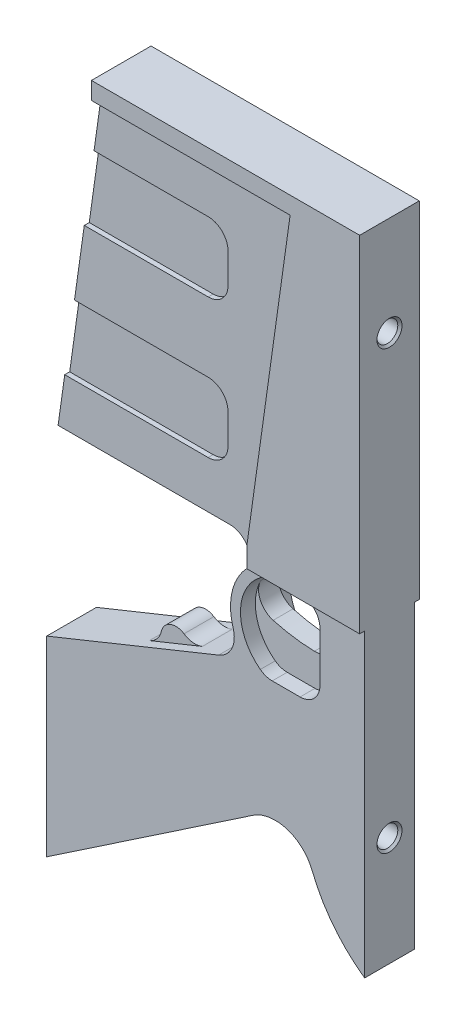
ISO-10303-21;
HEADER;
FILE_DESCRIPTION(('STEP AP214'),'2;1');
FILE_NAME('part.step','',(''),(''),'','','');
FILE_SCHEMA(('AUTOMOTIVE_DESIGN { 1 0 10303 214 1 1 1 1 }'));
ENDSEC;
DATA;
#1=APPLICATION_CONTEXT('core data for automotive mechanical design processes');
#2=APPLICATION_PROTOCOL_DEFINITION('international standard','automotive_design',2000,#1);
#3=PRODUCT_CONTEXT('',#1,'mechanical');
#4=PRODUCT('Part','Part','',(#3));
#5=PRODUCT_RELATED_PRODUCT_CATEGORY('part','',(#4));
#6=PRODUCT_DEFINITION_FORMATION('','',#4);
#7=PRODUCT_DEFINITION_CONTEXT('part definition',#1,'design');
#8=PRODUCT_DEFINITION('design','',#6,#7);
#9=PRODUCT_DEFINITION_SHAPE('','',#8);
#10=(LENGTH_UNIT() NAMED_UNIT(*) SI_UNIT(.MILLI.,.METRE.));
#11=(NAMED_UNIT(*) PLANE_ANGLE_UNIT() SI_UNIT($,.RADIAN.));
#12=(NAMED_UNIT(*) SI_UNIT($,.STERADIAN.) SOLID_ANGLE_UNIT());
#13=UNCERTAINTY_MEASURE_WITH_UNIT(LENGTH_MEASURE(1.E-05),#10,'distance_accuracy_value','');
#14=(GEOMETRIC_REPRESENTATION_CONTEXT(3) GLOBAL_UNCERTAINTY_ASSIGNED_CONTEXT((#13)) GLOBAL_UNIT_ASSIGNED_CONTEXT((#10,
#11,#12)) REPRESENTATION_CONTEXT('',''));
#15=CARTESIAN_POINT('',(0.,0.,0.));
#16=DIRECTION('',(0.,0.,1.));
#17=DIRECTION('',(1.,0.,0.));
#18=AXIS2_PLACEMENT_3D('',#15,#16,#17);
#19=CARTESIAN_POINT('',(-13.,46.5,5.));
#20=DIRECTION('',(0.,0.,-1.));
#21=DIRECTION('',(-1.,0.,0.));
#22=AXIS2_PLACEMENT_3D('',#19,#20,#21);
#23=CYLINDRICAL_SURFACE('',#22,4.);
#24=DIRECTION('',(0.,0.,-1.));
#25=VECTOR('',#24,1.);
#26=CARTESIAN_POINT('',(-13.,42.5,5.));
#27=LINE('',#26,#25);
#28=CARTESIAN_POINT('',(-13.,42.5,-2.));
#29=VERTEX_POINT('',#28);
#30=CARTESIAN_POINT('',(-13.,42.5,-5.));
#31=VERTEX_POINT('',#30);
#32=EDGE_CURVE('E697',#29,#31,#27,.T.);
#33=ORIENTED_EDGE('',*,*,#32,.F.);
#34=CARTESIAN_POINT('',(-13.,46.5,-2.));
#35=DIRECTION('',(0.,0.,1.));
#36=DIRECTION('',(1.,0.,0.));
#37=AXIS2_PLACEMENT_3D('',#34,#35,#36);
#38=CIRCLE('',#37,4.);
#39=CARTESIAN_POINT('',(-9.,46.5,-2.));
#40=VERTEX_POINT('',#39);
#41=EDGE_CURVE('E536',#29,#40,#38,.T.);
#42=ORIENTED_EDGE('',*,*,#41,.T.);
#43=DIRECTION('',(0.,0.,-1.));
#44=VECTOR('',#43,1.);
#45=CARTESIAN_POINT('',(-9.,46.5,5.));
#46=LINE('',#45,#44);
#47=CARTESIAN_POINT('',(-9.,46.5,-5.));
#48=VERTEX_POINT('',#47);
#49=EDGE_CURVE('E701',#40,#48,#46,.T.);
#50=ORIENTED_EDGE('',*,*,#49,.T.);
#51=CARTESIAN_POINT('',(-13.,46.5,-5.));
#52=DIRECTION('',(0.,0.,1.));
#53=DIRECTION('',(1.,0.,0.));
#54=AXIS2_PLACEMENT_3D('',#51,#52,#53);
#55=CIRCLE('',#54,4.);
#56=EDGE_CURVE('E675',#31,#48,#55,.T.);
#57=ORIENTED_EDGE('',*,*,#56,.F.);
#58=EDGE_LOOP('',(#33,#42,#50,#57));
#59=FACE_BOUND('',#58,.T.);
#60=ADVANCED_FACE('F51',(#59),#23,.F.);
#61=CARTESIAN_POINT('',(0.,42.5,5.));
#62=DIRECTION('',(0.,-1.,0.));
#63=DIRECTION('',(0.,0.,-1.));
#64=AXIS2_PLACEMENT_3D('',#61,#62,#63);
#65=PLANE('',#64);
#66=DIRECTION('',(-1.,0.,0.));
#67=VECTOR('',#66,1.);
#68=CARTESIAN_POINT('',(0.,42.5,-2.));
#69=LINE('',#68,#67);
#70=CARTESIAN_POINT('',(-18.6,42.5,-2.));
#71=VERTEX_POINT('',#70);
#72=EDGE_CURVE('E534',#29,#71,#69,.T.);
#73=ORIENTED_EDGE('',*,*,#72,.F.);
#74=ORIENTED_EDGE('',*,*,#32,.T.);
#75=DIRECTION('',(-1.,0.,0.));
#76=VECTOR('',#75,1.);
#77=CARTESIAN_POINT('',(0.,42.5,-5.));
#78=LINE('',#77,#76);
#79=CARTESIAN_POINT('',(-18.6,42.5,-5.));
#80=VERTEX_POINT('',#79);
#81=EDGE_CURVE('E678',#31,#80,#78,.T.);
#82=ORIENTED_EDGE('',*,*,#81,.T.);
#83=DIRECTION('',(0.,0.,-1.));
#84=VECTOR('',#83,1.);
#85=CARTESIAN_POINT('',(-18.6,42.5,5.));
#86=LINE('',#85,#84);
#87=EDGE_CURVE('E693',#71,#80,#86,.T.);
#88=ORIENTED_EDGE('',*,*,#87,.F.);
#89=EDGE_LOOP('',(#73,#74,#82,#88));
#90=FACE_BOUND('',#89,.T.);
#91=ADVANCED_FACE('F1090',(#90),#65,.F.);
#92=CARTESIAN_POINT('',(-18.6,46.5,5.));
#93=DIRECTION('',(0.,0.,-1.));
#94=DIRECTION('',(-1.,0.,0.));
#95=AXIS2_PLACEMENT_3D('',#92,#93,#94);
#96=CYLINDRICAL_SURFACE('',#95,4.);
#97=DIRECTION('',(0.,0.,-1.));
#98=VECTOR('',#97,1.);
#99=CARTESIAN_POINT('',(-21.,43.3,5.));
#100=LINE('',#99,#98);
#101=CARTESIAN_POINT('',(-21.,43.3,-2.));
#102=VERTEX_POINT('',#101);
#103=CARTESIAN_POINT('',(-21.,43.3,-5.));
#104=VERTEX_POINT('',#103);
#105=EDGE_CURVE('E688',#102,#104,#100,.T.);
#106=ORIENTED_EDGE('',*,*,#105,.F.);
#107=CARTESIAN_POINT('',(-18.6,46.5,-2.));
#108=DIRECTION('',(0.,0.,1.));
#109=DIRECTION('',(1.,0.,0.));
#110=AXIS2_PLACEMENT_3D('',#107,#108,#109);
#111=CIRCLE('',#110,4.);
#112=EDGE_CURVE('E67',#102,#71,#111,.T.);
#113=ORIENTED_EDGE('',*,*,#112,.T.);
#114=ORIENTED_EDGE('',*,*,#87,.T.);
#115=CARTESIAN_POINT('',(-18.6,46.5,-5.));
#116=DIRECTION('',(0.,0.,1.));
#117=DIRECTION('',(1.,0.,0.));
#118=AXIS2_PLACEMENT_3D('',#115,#116,#117);
#119=CIRCLE('',#118,4.);
#120=EDGE_CURVE('E681',#104,#80,#119,.T.);
#121=ORIENTED_EDGE('',*,*,#120,.F.);
#122=EDGE_LOOP('',(#106,#113,#114,#121));
#123=FACE_BOUND('',#122,.T.);
#124=ADVANCED_FACE('F1098',(#123),#96,.F.);
#125=CARTESIAN_POINT('',(0.,60.5,6.));
#126=DIRECTION('',(0.,-1.,0.));
#127=DIRECTION('',(1.,0.,0.));
#128=AXIS2_PLACEMENT_3D('',#125,#126,#127);
#129=PLANE('',#128);
#130=DIRECTION('',(0.,0.,-1.));
#131=VECTOR('',#130,1.);
#132=CARTESIAN_POINT('',(0.,60.5,6.));
#133=LINE('',#132,#131);
#134=CARTESIAN_POINT('',(0.,60.5,-5.));
#135=VERTEX_POINT('',#134);
#136=CARTESIAN_POINT('',(0.,60.5,-6.));
#137=VERTEX_POINT('',#136);
#138=EDGE_CURVE('E978',#135,#137,#133,.T.);
#139=ORIENTED_EDGE('',*,*,#138,.F.);
#140=DIRECTION('',(-1.,0.,0.));
#141=VECTOR('',#140,1.);
#142=CARTESIAN_POINT('',(0.,60.5,-5.));
#143=LINE('',#142,#141);
#144=CARTESIAN_POINT('',(-22.7147321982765,60.5,-5.));
#145=VERTEX_POINT('',#144);
#146=EDGE_CURVE('E586',#135,#145,#143,.T.);
#147=ORIENTED_EDGE('',*,*,#146,.T.);
#148=DIRECTION('',(0.,0.,-1.));
#149=VECTOR('',#148,1.);
#150=CARTESIAN_POINT('',(-22.7147321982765,60.5,6.));
#151=LINE('',#150,#149);
#152=CARTESIAN_POINT('',(-22.7147321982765,60.5,-6.));
#153=VERTEX_POINT('',#152);
#154=EDGE_CURVE('E982',#145,#153,#151,.T.);
#155=ORIENTED_EDGE('',*,*,#154,.T.);
#156=DIRECTION('',(-1.,0.,0.));
#157=VECTOR('',#156,1.);
#158=CARTESIAN_POINT('',(0.,60.5,-6.));
#159=LINE('',#158,#157);
#160=EDGE_CURVE('E972',#137,#153,#159,.T.);
#161=ORIENTED_EDGE('',*,*,#160,.F.);
#162=EDGE_LOOP('',(#139,#147,#155,#161));
#163=FACE_BOUND('',#162,.T.);
#164=ADVANCED_FACE('F1172',(#163),#129,.T.);
#165=DIRECTION('',(0.,0.,-1.));
#166=VECTOR('',#165,1.);
#167=CARTESIAN_POINT('',(-22.7147321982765,60.5,5.));
#168=LINE('',#167,#166);
#169=CARTESIAN_POINT('',(-22.7147321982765,60.5,4.));
#170=VERTEX_POINT('',#169);
#171=CARTESIAN_POINT('',(-22.7147321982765,60.5,-4.));
#172=VERTEX_POINT('',#171);
#173=EDGE_CURVE('E11',#170,#172,#168,.T.);
#174=ORIENTED_EDGE('',*,*,#173,.F.);
#175=DIRECTION('',(-1.,0.,0.));
#176=VECTOR('',#175,1.);
#177=CARTESIAN_POINT('',(0.,60.5,4.));
#178=LINE('',#177,#176);
#179=CARTESIAN_POINT('',(-24.0904545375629,60.5,4.));
#180=VERTEX_POINT('',#179);
#181=EDGE_CURVE('E791',#170,#180,#178,.T.);
#182=ORIENTED_EDGE('',*,*,#181,.T.);
#183=DIRECTION('',(0.,0.,-1.));
#184=VECTOR('',#183,1.);
#185=CARTESIAN_POINT('',(-24.0904545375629,60.5,4.));
#186=LINE('',#185,#184);
#187=CARTESIAN_POINT('',(-24.0904545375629,60.5,-4.));
#188=VERTEX_POINT('',#187);
#189=EDGE_CURVE('E937',#180,#188,#186,.T.);
#190=ORIENTED_EDGE('',*,*,#189,.T.);
#191=DIRECTION('',(-1.,0.,0.));
#192=VECTOR('',#191,1.);
#193=CARTESIAN_POINT('',(0.,60.5,-4.));
#194=LINE('',#193,#192);
#195=EDGE_CURVE('E837',#172,#188,#194,.T.);
#196=ORIENTED_EDGE('',*,*,#195,.F.);
#197=EDGE_LOOP('',(#174,#182,#190,#196));
#198=FACE_BOUND('',#197,.T.);
#199=ADVANCED_FACE('F1027',(#198),#129,.T.);
#200=CARTESIAN_POINT('',(0.,116.,4.));
#201=DIRECTION('',(0.,1.,0.));
#202=DIRECTION('',(0.,0.,1.));
#203=AXIS2_PLACEMENT_3D('',#200,#201,#202);
#204=PLANE('',#203);
#205=DIRECTION('',(1.,0.,0.));
#206=VECTOR('',#205,1.);
#207=CARTESIAN_POINT('',(0.,116.,-3.));
#208=LINE('',#207,#206);
#209=CARTESIAN_POINT('',(-55.4756787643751,116.,-3.));
#210=VERTEX_POINT('',#209);
#211=CARTESIAN_POINT('',(-32.5,116.,-3.));
#212=VERTEX_POINT('',#211);
#213=EDGE_CURVE('E751',#210,#212,#208,.T.);
#214=ORIENTED_EDGE('',*,*,#213,.F.);
#215=DIRECTION('',(0.,0.,-1.));
#216=VECTOR('',#215,1.);
#217=CARTESIAN_POINT('',(-55.4756787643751,116.,4.));
#218=LINE('',#217,#216);
#219=CARTESIAN_POINT('',(-55.4756787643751,116.,-4.));
#220=VERTEX_POINT('',#219);
#221=EDGE_CURVE('E931',#210,#220,#218,.T.);
#222=ORIENTED_EDGE('',*,*,#221,.T.);
#223=DIRECTION('',(1.,0.,0.));
#224=VECTOR('',#223,1.);
#225=CARTESIAN_POINT('',(0.,116.,-4.));
#226=LINE('',#225,#224);
#227=CARTESIAN_POINT('',(-32.5,116.,-4.));
#228=VERTEX_POINT('',#227);
#229=EDGE_CURVE('E849',#220,#228,#226,.T.);
#230=ORIENTED_EDGE('',*,*,#229,.T.);
#231=DIRECTION('',(0.,0.,-1.));
#232=VECTOR('',#231,1.);
#233=CARTESIAN_POINT('',(-32.5,116.,4.));
#234=LINE('',#233,#232);
#235=EDGE_CURVE('E927',#212,#228,#234,.T.);
#236=ORIENTED_EDGE('',*,*,#235,.F.);
#237=EDGE_LOOP('',(#214,#222,#230,#236));
#238=FACE_BOUND('',#237,.T.);
#239=ADVANCED_FACE('F1225',(#238),#204,.F.);
#240=CARTESIAN_POINT('',(-32.5,112.,4.));
#241=DIRECTION('',(0.,0.,-1.));
#242=DIRECTION('',(-1.,0.,0.));
#243=AXIS2_PLACEMENT_3D('',#240,#241,#242);
#244=CYLINDRICAL_SURFACE('',#243,4.);
#245=DIRECTION('',(0.,0.,-1.));
#246=VECTOR('',#245,1.);
#247=CARTESIAN_POINT('',(-28.5,112.,4.));
#248=LINE('',#247,#246);
#249=CARTESIAN_POINT('',(-28.5,112.,-3.));
#250=VERTEX_POINT('',#249);
#251=CARTESIAN_POINT('',(-28.5,112.,-4.));
#252=VERTEX_POINT('',#251);
#253=EDGE_CURVE('E923',#250,#252,#248,.T.);
#254=ORIENTED_EDGE('',*,*,#253,.F.);
#255=CARTESIAN_POINT('',(-32.5,112.,-3.));
#256=DIRECTION('',(0.,0.,1.));
#257=DIRECTION('',(1.,0.,0.));
#258=AXIS2_PLACEMENT_3D('',#255,#256,#257);
#259=CIRCLE('',#258,4.);
#260=EDGE_CURVE('E747',#250,#212,#259,.T.);
#261=ORIENTED_EDGE('',*,*,#260,.T.);
#262=ORIENTED_EDGE('',*,*,#235,.T.);
#263=CARTESIAN_POINT('',(-32.5,112.,-4.));
#264=DIRECTION('',(0.,0.,1.));
#265=DIRECTION('',(1.,0.,0.));
#266=AXIS2_PLACEMENT_3D('',#263,#264,#265);
#267=CIRCLE('',#266,4.);
#268=EDGE_CURVE('E854',#252,#228,#267,.T.);
#269=ORIENTED_EDGE('',*,*,#268,.F.);
#270=EDGE_LOOP('',(#254,#261,#262,#269));
#271=FACE_BOUND('',#270,.T.);
#272=ADVANCED_FACE('F1305',(#271),#244,.F.);
#273=CARTESIAN_POINT('',(-28.5,0.,4.));
#274=DIRECTION('',(1.,0.,0.));
#275=DIRECTION('',(0.,0.,-1.));
#276=AXIS2_PLACEMENT_3D('',#273,#274,#275);
#277=PLANE('',#276);
#278=DIRECTION('',(0.,-1.,0.));
#279=VECTOR('',#278,1.);
#280=CARTESIAN_POINT('',(-28.5,0.,-3.));
#281=LINE('',#280,#279);
#282=CARTESIAN_POINT('',(-28.5,106.,-3.));
#283=VERTEX_POINT('',#282);
#284=EDGE_CURVE('E745',#250,#283,#281,.T.);
#285=ORIENTED_EDGE('',*,*,#284,.F.);
#286=ORIENTED_EDGE('',*,*,#253,.T.);
#287=DIRECTION('',(0.,-1.,0.));
#288=VECTOR('',#287,1.);
#289=CARTESIAN_POINT('',(-28.5,0.,-4.));
#290=LINE('',#289,#288);
#291=CARTESIAN_POINT('',(-28.5,106.,-4.));
#292=VERTEX_POINT('',#291);
#293=EDGE_CURVE('E857',#252,#292,#290,.T.);
#294=ORIENTED_EDGE('',*,*,#293,.T.);
#295=DIRECTION('',(0.,0.,-1.));
#296=VECTOR('',#295,1.);
#297=CARTESIAN_POINT('',(-28.5,106.,4.));
#298=LINE('',#297,#296);
#299=EDGE_CURVE('E919',#283,#292,#298,.T.);
#300=ORIENTED_EDGE('',*,*,#299,.F.);
#301=EDGE_LOOP('',(#285,#286,#294,#300));
#302=FACE_BOUND('',#301,.T.);
#303=ADVANCED_FACE('F1302',(#302),#277,.F.);
#304=CARTESIAN_POINT('',(-32.5,106.,4.));
#305=DIRECTION('',(0.,0.,-1.));
#306=DIRECTION('',(-1.,0.,0.));
#307=AXIS2_PLACEMENT_3D('',#304,#305,#306);
#308=CYLINDRICAL_SURFACE('',#307,4.);
#309=DIRECTION('',(0.,0.,-1.));
#310=VECTOR('',#309,1.);
#311=CARTESIAN_POINT('',(-32.5,102.,4.));
#312=LINE('',#311,#310);
#313=CARTESIAN_POINT('',(-32.5,102.,-3.));
#314=VERTEX_POINT('',#313);
#315=CARTESIAN_POINT('',(-32.5,102.,-4.));
#316=VERTEX_POINT('',#315);
#317=EDGE_CURVE('E915',#314,#316,#312,.T.);
#318=ORIENTED_EDGE('',*,*,#317,.F.);
#319=CARTESIAN_POINT('',(-32.5,106.,-3.));
#320=DIRECTION('',(0.,0.,1.));
#321=DIRECTION('',(1.,0.,0.));
#322=AXIS2_PLACEMENT_3D('',#319,#320,#321);
#323=CIRCLE('',#322,4.);
#324=EDGE_CURVE('E732',#314,#283,#323,.T.);
#325=ORIENTED_EDGE('',*,*,#324,.T.);
#326=ORIENTED_EDGE('',*,*,#299,.T.);
#327=CARTESIAN_POINT('',(-32.5,106.,-4.));
#328=DIRECTION('',(0.,0.,1.));
#329=DIRECTION('',(1.,0.,0.));
#330=AXIS2_PLACEMENT_3D('',#327,#328,#329);
#331=CIRCLE('',#330,4.);
#332=EDGE_CURVE('E860',#316,#292,#331,.T.);
#333=ORIENTED_EDGE('',*,*,#332,.F.);
#334=EDGE_LOOP('',(#318,#325,#326,#333));
#335=FACE_BOUND('',#334,.T.);
#336=ADVANCED_FACE('F1298',(#335),#308,.F.);
#337=CARTESIAN_POINT('',(0.,102.,4.));
#338=DIRECTION('',(0.,-1.,0.));
#339=DIRECTION('',(0.,0.,-1.));
#340=AXIS2_PLACEMENT_3D('',#337,#338,#339);
#341=PLANE('',#340);
#342=DIRECTION('',(-1.,0.,0.));
#343=VECTOR('',#342,1.);
#344=CARTESIAN_POINT('',(0.,102.,-3.));
#345=LINE('',#344,#343);
#346=CARTESIAN_POINT('',(-57.4432504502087,102.,-3.));
#347=VERTEX_POINT('',#346);
#348=EDGE_CURVE('E756',#314,#347,#345,.T.);
#349=ORIENTED_EDGE('',*,*,#348,.F.);
#350=ORIENTED_EDGE('',*,*,#317,.T.);
#351=DIRECTION('',(-1.,0.,0.));
#352=VECTOR('',#351,1.);
#353=CARTESIAN_POINT('',(0.,102.,-4.));
#354=LINE('',#353,#352);
#355=CARTESIAN_POINT('',(-57.4432504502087,102.,-4.));
#356=VERTEX_POINT('',#355);
#357=EDGE_CURVE('E863',#316,#356,#354,.T.);
#358=ORIENTED_EDGE('',*,*,#357,.T.);
#359=DIRECTION('',(0.,0.,-1.));
#360=VECTOR('',#359,1.);
#361=CARTESIAN_POINT('',(-57.4432504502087,102.,4.));
#362=LINE('',#361,#360);
#363=EDGE_CURVE('E911',#347,#356,#362,.T.);
#364=ORIENTED_EDGE('',*,*,#363,.F.);
#365=EDGE_LOOP('',(#349,#350,#358,#364));
#366=FACE_BOUND('',#365,.T.);
#367=ADVANCED_FACE('F1294',(#366),#341,.F.);
#368=CARTESIAN_POINT('',(0.,88.,4.));
#369=DIRECTION('',(0.,1.,0.));
#370=DIRECTION('',(-1.,0.,0.));
#371=AXIS2_PLACEMENT_3D('',#368,#369,#370);
#372=PLANE('',#371);
#373=DIRECTION('',(1.,0.,0.));
#374=VECTOR('',#373,1.);
#375=CARTESIAN_POINT('',(0.,88.,-3.));
#376=LINE('',#375,#374);
#377=CARTESIAN_POINT('',(-59.4108221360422,88.,-3.));
#378=VERTEX_POINT('',#377);
#379=CARTESIAN_POINT('',(-32.5,88.,-3.));
#380=VERTEX_POINT('',#379);
#381=EDGE_CURVE('E779',#378,#380,#376,.T.);
#382=ORIENTED_EDGE('',*,*,#381,.F.);
#383=DIRECTION('',(0.,0.,-1.));
#384=VECTOR('',#383,1.);
#385=CARTESIAN_POINT('',(-59.4108221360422,88.,4.));
#386=LINE('',#385,#384);
#387=CARTESIAN_POINT('',(-59.4108221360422,88.,-4.));
#388=VERTEX_POINT('',#387);
#389=EDGE_CURVE('E907',#378,#388,#386,.T.);
#390=ORIENTED_EDGE('',*,*,#389,.T.);
#391=DIRECTION('',(1.,0.,0.));
#392=VECTOR('',#391,1.);
#393=CARTESIAN_POINT('',(0.,88.,-4.));
#394=LINE('',#393,#392);
#395=CARTESIAN_POINT('',(-32.5,88.,-4.));
#396=VERTEX_POINT('',#395);
#397=EDGE_CURVE('E866',#388,#396,#394,.T.);
#398=ORIENTED_EDGE('',*,*,#397,.T.);
#399=DIRECTION('',(0.,0.,-1.));
#400=VECTOR('',#399,1.);
#401=CARTESIAN_POINT('',(-32.5,88.,4.));
#402=LINE('',#401,#400);
#403=EDGE_CURVE('E903',#380,#396,#402,.T.);
#404=ORIENTED_EDGE('',*,*,#403,.F.);
#405=EDGE_LOOP('',(#382,#390,#398,#404));
#406=FACE_BOUND('',#405,.T.);
#407=ADVANCED_FACE('F1057',(#406),#372,.F.);
#408=CARTESIAN_POINT('',(-32.5,84.,4.));
#409=DIRECTION('',(0.,0.,-1.));
#410=DIRECTION('',(-1.,0.,0.));
#411=AXIS2_PLACEMENT_3D('',#408,#409,#410);
#412=CYLINDRICAL_SURFACE('',#411,4.);
#413=DIRECTION('',(0.,0.,-1.));
#414=VECTOR('',#413,1.);
#415=CARTESIAN_POINT('',(-28.5,84.,4.));
#416=LINE('',#415,#414);
#417=CARTESIAN_POINT('',(-28.5,84.,-3.));
#418=VERTEX_POINT('',#417);
#419=CARTESIAN_POINT('',(-28.5,84.,-4.));
#420=VERTEX_POINT('',#419);
#421=EDGE_CURVE('E899',#418,#420,#416,.T.);
#422=ORIENTED_EDGE('',*,*,#421,.F.);
#423=CARTESIAN_POINT('',(-32.5,84.,-3.));
#424=DIRECTION('',(0.,0.,1.));
#425=DIRECTION('',(1.,0.,0.));
#426=AXIS2_PLACEMENT_3D('',#423,#424,#425);
#427=CIRCLE('',#426,4.);
#428=EDGE_CURVE('E776',#418,#380,#427,.T.);
#429=ORIENTED_EDGE('',*,*,#428,.T.);
#430=ORIENTED_EDGE('',*,*,#403,.T.);
#431=CARTESIAN_POINT('',(-32.5,84.,-4.));
#432=DIRECTION('',(0.,0.,1.));
#433=DIRECTION('',(1.,0.,0.));
#434=AXIS2_PLACEMENT_3D('',#431,#432,#433);
#435=CIRCLE('',#434,4.);
#436=EDGE_CURVE('E869',#420,#396,#435,.T.);
#437=ORIENTED_EDGE('',*,*,#436,.F.);
#438=EDGE_LOOP('',(#422,#429,#430,#437));
#439=FACE_BOUND('',#438,.T.);
#440=ADVANCED_FACE('F1063',(#439),#412,.F.);
#441=CARTESIAN_POINT('',(-28.5,0.,4.));
#442=DIRECTION('',(1.,0.,0.));
#443=DIRECTION('',(0.,0.,-1.));
#444=AXIS2_PLACEMENT_3D('',#441,#442,#443);
#445=PLANE('',#444);
#446=DIRECTION('',(0.,-1.,0.));
#447=VECTOR('',#446,1.);
#448=CARTESIAN_POINT('',(-28.5,0.,-3.));
#449=LINE('',#448,#447);
#450=CARTESIAN_POINT('',(-28.5,78.,-3.));
#451=VERTEX_POINT('',#450);
#452=EDGE_CURVE('E711',#418,#451,#449,.T.);
#453=ORIENTED_EDGE('',*,*,#452,.F.);
#454=ORIENTED_EDGE('',*,*,#421,.T.);
#455=DIRECTION('',(0.,-1.,0.));
#456=VECTOR('',#455,1.);
#457=CARTESIAN_POINT('',(-28.5,0.,-4.));
#458=LINE('',#457,#456);
#459=CARTESIAN_POINT('',(-28.5,78.,-4.));
#460=VERTEX_POINT('',#459);
#461=EDGE_CURVE('E872',#420,#460,#458,.T.);
#462=ORIENTED_EDGE('',*,*,#461,.T.);
#463=DIRECTION('',(0.,0.,-1.));
#464=VECTOR('',#463,1.);
#465=CARTESIAN_POINT('',(-28.5,78.,4.));
#466=LINE('',#465,#464);
#467=EDGE_CURVE('E895',#451,#460,#466,.T.);
#468=ORIENTED_EDGE('',*,*,#467,.F.);
#469=EDGE_LOOP('',(#453,#454,#462,#468));
#470=FACE_BOUND('',#469,.T.);
#471=ADVANCED_FACE('F1065',(#470),#445,.F.);
#472=CARTESIAN_POINT('',(-32.5,78.,4.));
#473=DIRECTION('',(0.,0.,-1.));
#474=DIRECTION('',(-1.,0.,0.));
#475=AXIS2_PLACEMENT_3D('',#472,#473,#474);
#476=CYLINDRICAL_SURFACE('',#475,4.);
#477=DIRECTION('',(0.,0.,-1.));
#478=VECTOR('',#477,1.);
#479=CARTESIAN_POINT('',(-32.5,74.,4.));
#480=LINE('',#479,#478);
#481=CARTESIAN_POINT('',(-32.5,74.,-3.));
#482=VERTEX_POINT('',#481);
#483=CARTESIAN_POINT('',(-32.5,74.,-4.));
#484=VERTEX_POINT('',#483);
#485=EDGE_CURVE('E891',#482,#484,#480,.T.);
#486=ORIENTED_EDGE('',*,*,#485,.F.);
#487=CARTESIAN_POINT('',(-32.5,78.,-3.));
#488=DIRECTION('',(0.,0.,1.));
#489=DIRECTION('',(1.,0.,0.));
#490=AXIS2_PLACEMENT_3D('',#487,#488,#489);
#491=CIRCLE('',#490,4.);
#492=EDGE_CURVE('E764',#482,#451,#491,.T.);
#493=ORIENTED_EDGE('',*,*,#492,.T.);
#494=ORIENTED_EDGE('',*,*,#467,.T.);
#495=CARTESIAN_POINT('',(-32.5,78.,-4.));
#496=DIRECTION('',(0.,0.,1.));
#497=DIRECTION('',(1.,0.,0.));
#498=AXIS2_PLACEMENT_3D('',#495,#496,#497);
#499=CIRCLE('',#498,4.);
#500=EDGE_CURVE('E875',#484,#460,#499,.T.);
#501=ORIENTED_EDGE('',*,*,#500,.F.);
#502=EDGE_LOOP('',(#486,#493,#494,#501));
#503=FACE_BOUND('',#502,.T.);
#504=ADVANCED_FACE('F1070',(#503),#476,.F.);
#505=CARTESIAN_POINT('',(0.,74.,4.));
#506=DIRECTION('',(0.,-1.,0.));
#507=DIRECTION('',(1.,0.,0.));
#508=AXIS2_PLACEMENT_3D('',#505,#506,#507);
#509=PLANE('',#508);
#510=DIRECTION('',(-1.,0.,0.));
#511=VECTOR('',#510,1.);
#512=CARTESIAN_POINT('',(0.,74.,-3.));
#513=LINE('',#512,#511);
#514=CARTESIAN_POINT('',(-61.3783938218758,74.,-3.));
#515=VERTEX_POINT('',#514);
#516=EDGE_CURVE('E784',#482,#515,#513,.T.);
#517=ORIENTED_EDGE('',*,*,#516,.F.);
#518=ORIENTED_EDGE('',*,*,#485,.T.);
#519=DIRECTION('',(-1.,0.,0.));
#520=VECTOR('',#519,1.);
#521=CARTESIAN_POINT('',(0.,74.,-4.));
#522=LINE('',#521,#520);
#523=CARTESIAN_POINT('',(-61.3783938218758,74.,-4.));
#524=VERTEX_POINT('',#523);
#525=EDGE_CURVE('E878',#484,#524,#522,.T.);
#526=ORIENTED_EDGE('',*,*,#525,.T.);
#527=DIRECTION('',(0.,0.,-1.));
#528=VECTOR('',#527,1.);
#529=CARTESIAN_POINT('',(-61.3783938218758,74.,4.));
#530=LINE('',#529,#528);
#531=EDGE_CURVE('E887',#515,#524,#530,.T.);
#532=ORIENTED_EDGE('',*,*,#531,.F.);
#533=EDGE_LOOP('',(#517,#518,#526,#532));
#534=FACE_BOUND('',#533,.T.);
#535=ADVANCED_FACE('F1073',(#534),#509,.F.);
#536=CARTESIAN_POINT('',(0.,126.5,6.));
#537=DIRECTION('',(0.,1.,0.));
#538=DIRECTION('',(0.,0.,1.));
#539=AXIS2_PLACEMENT_3D('',#536,#537,#538);
#540=PLANE('',#539);
#541=DIRECTION('',(1.,0.,0.));
#542=VECTOR('',#541,1.);
#543=CARTESIAN_POINT('',(0.,126.5,-4.));
#544=LINE('',#543,#542);
#545=CARTESIAN_POINT('',(-54.,126.5,-4.));
#546=VERTEX_POINT('',#545);
#547=CARTESIAN_POINT('',(-14.,126.5,-4.));
#548=VERTEX_POINT('',#547);
#549=EDGE_CURVE('E844',#546,#548,#544,.T.);
#550=ORIENTED_EDGE('',*,*,#549,.F.);
#551=DIRECTION('',(0.,0.,-1.));
#552=VECTOR('',#551,1.);
#553=CARTESIAN_POINT('',(-54.,126.5,6.));
#554=LINE('',#553,#552);
#555=CARTESIAN_POINT('',(-54.,126.5,-6.));
#556=VERTEX_POINT('',#555);
#557=EDGE_CURVE('E992',#546,#556,#554,.T.);
#558=ORIENTED_EDGE('',*,*,#557,.T.);
#559=DIRECTION('',(1.,0.,0.));
#560=VECTOR('',#559,1.);
#561=CARTESIAN_POINT('',(0.,126.5,-6.));
#562=LINE('',#561,#560);
#563=CARTESIAN_POINT('',(-14.,126.5,-6.));
#564=VERTEX_POINT('',#563);
#565=EDGE_CURVE('E963',#556,#564,#562,.T.);
#566=ORIENTED_EDGE('',*,*,#565,.T.);
#567=DIRECTION('',(0.,0.,-1.));
#568=VECTOR('',#567,1.);
#569=CARTESIAN_POINT('',(-14.,126.5,6.));
#570=LINE('',#569,#568);
#571=EDGE_CURVE('E989',#548,#564,#570,.T.);
#572=ORIENTED_EDGE('',*,*,#571,.F.);
#573=EDGE_LOOP('',(#550,#558,#566,#572));
#574=FACE_BOUND('',#573,.T.);
#575=ADVANCED_FACE('F1002',(#574),#540,.F.);
#576=CARTESIAN_POINT('',(-31.1628946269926,4.37965922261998,6.));
#577=DIRECTION('',(0.990268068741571,-0.139173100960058,0.));
#578=DIRECTION('',(0.139173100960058,0.990268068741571,0.));
#579=AXIS2_PLACEMENT_3D('',#576,#577,#578);
#580=PLANE('',#579);
#581=DIRECTION('',(-0.139173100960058,-0.990268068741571,0.));
#582=VECTOR('',#581,1.);
#583=CARTESIAN_POINT('',(-31.1628946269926,4.37965922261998,-4.));
#584=LINE('',#583,#582);
#585=CARTESIAN_POINT('',(-22.7147321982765,64.4914583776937,-4.));
#586=VERTEX_POINT('',#585);
#587=EDGE_CURVE('E842',#548,#586,#584,.T.);
#588=ORIENTED_EDGE('',*,*,#587,.F.);
#589=ORIENTED_EDGE('',*,*,#571,.T.);
#590=DIRECTION('',(-0.139173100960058,-0.990268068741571,0.));
#591=VECTOR('',#590,1.);
#592=CARTESIAN_POINT('',(-31.1628946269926,4.37965922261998,-6.));
#593=LINE('',#592,#591);
#594=CARTESIAN_POINT('',(-22.7147321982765,64.4914583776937,-6.));
#595=VERTEX_POINT('',#594);
#596=EDGE_CURVE('E966',#564,#595,#593,.T.);
#597=ORIENTED_EDGE('',*,*,#596,.T.);
#598=DIRECTION('',(0.,0.,-1.));
#599=VECTOR('',#598,1.);
#600=CARTESIAN_POINT('',(-22.7147321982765,64.4914583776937,6.));
#601=LINE('',#600,#599);
#602=EDGE_CURVE('E985',#586,#595,#601,.T.);
#603=ORIENTED_EDGE('',*,*,#602,.F.);
#604=EDGE_LOOP('',(#588,#589,#597,#603));
#605=FACE_BOUND('',#604,.T.);
#606=ADVANCED_FACE('F1017',(#605),#580,.F.);
#607=CARTESIAN_POINT('',(0.,130.,6.));
#608=DIRECTION('',(0.,-1.,0.));
#609=DIRECTION('',(0.,0.,-1.));
#610=AXIS2_PLACEMENT_3D('',#607,#608,#609);
#611=PLANE('',#610);
#612=DIRECTION('',(-1.,0.,0.));
#613=VECTOR('',#612,1.);
#614=CARTESIAN_POINT('',(0.,130.,-6.));
#615=LINE('',#614,#613);
#616=CARTESIAN_POINT('',(0.,130.,-6.));
#617=VERTEX_POINT('',#616);
#618=CARTESIAN_POINT('',(-54.,130.,-6.));
#619=VERTEX_POINT('',#618);
#620=EDGE_CURVE('E939',#617,#619,#615,.T.);
#621=ORIENTED_EDGE('',*,*,#620,.T.);
#622=DIRECTION('',(0.,0.,-1.));
#623=VECTOR('',#622,1.);
#624=CARTESIAN_POINT('',(-54.,130.,6.));
#625=LINE('',#624,#623);
#626=CARTESIAN_POINT('',(-54.,130.,6.));
#627=VERTEX_POINT('',#626);
#628=EDGE_CURVE('E55',#627,#619,#625,.T.);
#629=ORIENTED_EDGE('',*,*,#628,.F.);
#630=DIRECTION('',(-1.,0.,0.));
#631=VECTOR('',#630,1.);
#632=CARTESIAN_POINT('',(0.,130.,6.));
#633=LINE('',#632,#631);
#634=CARTESIAN_POINT('',(0.,130.,6.));
#635=VERTEX_POINT('',#634);
#636=EDGE_CURVE('E940',#635,#627,#633,.T.);
#637=ORIENTED_EDGE('',*,*,#636,.F.);
#638=DIRECTION('',(0.,0.,-1.));
#639=VECTOR('',#638,1.);
#640=CARTESIAN_POINT('',(0.,130.,6.));
#641=LINE('',#640,#639);
#642=EDGE_CURVE('E957',#635,#617,#641,.T.);
#643=ORIENTED_EDGE('',*,*,#642,.T.);
#644=EDGE_LOOP('',(#621,#629,#637,#643));
#645=FACE_BOUND('',#644,.T.);
#646=ADVANCED_FACE('F53',(#645),#611,.F.);
#647=CARTESIAN_POINT('',(-54.,0.,6.));
#648=DIRECTION('',(1.,0.,0.));
#649=DIRECTION('',(0.,0.,-1.));
#650=AXIS2_PLACEMENT_3D('',#647,#648,#649);
#651=PLANE('',#650);
#652=DIRECTION('',(0.,-1.,0.));
#653=VECTOR('',#652,1.);
#654=CARTESIAN_POINT('',(-54.,0.,-6.));
#655=LINE('',#654,#653);
#656=EDGE_CURVE('E960',#619,#556,#655,.T.);
#657=ORIENTED_EDGE('',*,*,#656,.T.);
#658=ORIENTED_EDGE('',*,*,#557,.F.);
#659=DIRECTION('',(0.,0.,-1.));
#660=VECTOR('',#659,1.);
#661=CARTESIAN_POINT('',(-54.,126.5,4.));
#662=LINE('',#661,#660);
#663=CARTESIAN_POINT('',(-54.,126.5,4.));
#664=VERTEX_POINT('',#663);
#665=EDGE_CURVE('E935',#664,#546,#662,.T.);
#666=ORIENTED_EDGE('',*,*,#665,.F.);
#667=CARTESIAN_POINT('',(-54.,126.5,6.));
#668=VERTEX_POINT('',#667);
#669=EDGE_CURVE('E993',#668,#664,#554,.T.);
#670=ORIENTED_EDGE('',*,*,#669,.F.);
#671=DIRECTION('',(0.,-1.,0.));
#672=VECTOR('',#671,1.);
#673=CARTESIAN_POINT('',(-54.,0.,6.));
#674=LINE('',#673,#672);
#675=EDGE_CURVE('E943',#627,#668,#674,.T.);
#676=ORIENTED_EDGE('',*,*,#675,.F.);
#677=ORIENTED_EDGE('',*,*,#628,.T.);
#678=EDGE_LOOP('',(#657,#658,#666,#670,#676,#677));
#679=FACE_BOUND('',#678,.T.);
#680=ADVANCED_FACE('F1008',(#679),#651,.F.);
#681=ORIENTED_EDGE('',*,*,#669,.T.);
#682=DIRECTION('',(1.,0.,0.));
#683=VECTOR('',#682,1.);
#684=CARTESIAN_POINT('',(0.,126.5,4.));
#685=LINE('',#684,#683);
#686=CARTESIAN_POINT('',(-14.,126.5,4.));
#687=VERTEX_POINT('',#686);
#688=EDGE_CURVE('E801',#664,#687,#685,.T.);
#689=ORIENTED_EDGE('',*,*,#688,.T.);
#690=CARTESIAN_POINT('',(-14.,126.5,6.));
#691=VERTEX_POINT('',#690);
#692=EDGE_CURVE('E990',#691,#687,#570,.T.);
#693=ORIENTED_EDGE('',*,*,#692,.F.);
#694=DIRECTION('',(1.,0.,0.));
#695=VECTOR('',#694,1.);
#696=CARTESIAN_POINT('',(0.,126.5,6.));
#697=LINE('',#696,#695);
#698=EDGE_CURVE('E946',#668,#691,#697,.T.);
#699=ORIENTED_EDGE('',*,*,#698,.F.);
#700=EDGE_LOOP('',(#681,#689,#693,#699));
#701=FACE_BOUND('',#700,.T.);
#702=ADVANCED_FACE('F1083',(#701),#540,.F.);
#703=ORIENTED_EDGE('',*,*,#692,.T.);
#704=DIRECTION('',(-0.139173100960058,-0.990268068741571,0.));
#705=VECTOR('',#704,1.);
#706=CARTESIAN_POINT('',(-31.1628946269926,4.37965922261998,4.));
#707=LINE('',#706,#705);
#708=CARTESIAN_POINT('',(-22.7147321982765,64.4914583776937,4.));
#709=VERTEX_POINT('',#708);
#710=EDGE_CURVE('E798',#687,#709,#707,.T.);
#711=ORIENTED_EDGE('',*,*,#710,.T.);
#712=CARTESIAN_POINT('',(-22.7147321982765,64.4914583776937,6.));
#713=VERTEX_POINT('',#712);
#714=EDGE_CURVE('E986',#713,#709,#601,.T.);
#715=ORIENTED_EDGE('',*,*,#714,.F.);
#716=DIRECTION('',(-0.139173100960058,-0.990268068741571,0.));
#717=VECTOR('',#716,1.);
#718=CARTESIAN_POINT('',(-31.1628946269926,4.37965922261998,6.));
#719=LINE('',#718,#717);
#720=EDGE_CURVE('E948',#691,#713,#719,.T.);
#721=ORIENTED_EDGE('',*,*,#720,.F.);
#722=EDGE_LOOP('',(#703,#711,#715,#721));
#723=FACE_BOUND('',#722,.T.);
#724=ADVANCED_FACE('F1247',(#723),#580,.F.);
#725=CARTESIAN_POINT('',(-22.7147321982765,0.,6.));
#726=DIRECTION('',(1.,0.,0.));
#727=DIRECTION('',(0.,0.,-1.));
#728=AXIS2_PLACEMENT_3D('',#725,#726,#727);
#729=PLANE('',#728);
#730=ORIENTED_EDGE('',*,*,#714,.T.);
#731=DIRECTION('',(0.,-1.,0.));
#732=VECTOR('',#731,1.);
#733=CARTESIAN_POINT('',(-22.7147321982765,0.,4.));
#734=LINE('',#733,#732);
#735=EDGE_CURVE('E795',#709,#170,#734,.T.);
#736=ORIENTED_EDGE('',*,*,#735,.T.);
#737=ORIENTED_EDGE('',*,*,#173,.T.);
#738=DIRECTION('',(0.,-1.,0.));
#739=VECTOR('',#738,1.);
#740=CARTESIAN_POINT('',(-22.7147321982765,0.,-4.));
#741=LINE('',#740,#739);
#742=EDGE_CURVE('E840',#586,#172,#741,.T.);
#743=ORIENTED_EDGE('',*,*,#742,.F.);
#744=ORIENTED_EDGE('',*,*,#602,.T.);
#745=DIRECTION('',(0.,-1.,0.));
#746=VECTOR('',#745,1.);
#747=CARTESIAN_POINT('',(-22.7147321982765,0.,-6.));
#748=LINE('',#747,#746);
#749=EDGE_CURVE('E969',#595,#153,#748,.T.);
#750=ORIENTED_EDGE('',*,*,#749,.T.);
#751=ORIENTED_EDGE('',*,*,#154,.F.);
#752=DIRECTION('',(0.,-1.,0.));
#753=VECTOR('',#752,1.);
#754=CARTESIAN_POINT('',(-22.7147321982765,0.,-5.));
#755=LINE('',#754,#753);
#756=CARTESIAN_POINT('',(-22.7147321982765,60.4914583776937,-5.));
#757=VERTEX_POINT('',#756);
#758=EDGE_CURVE('E638',#145,#757,#755,.T.);
#759=ORIENTED_EDGE('',*,*,#758,.T.);
#760=DIRECTION('',(0.,0.,-1.));
#761=VECTOR('',#760,1.);
#762=CARTESIAN_POINT('',(-22.7147321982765,60.4914583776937,5.));
#763=LINE('',#762,#761);
#764=CARTESIAN_POINT('',(-22.7147321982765,60.4914583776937,5.));
#765=VERTEX_POINT('',#764);
#766=EDGE_CURVE('E689',#765,#757,#763,.T.);
#767=ORIENTED_EDGE('',*,*,#766,.F.);
#768=DIRECTION('',(0.,-1.,0.));
#769=VECTOR('',#768,1.);
#770=CARTESIAN_POINT('',(-22.7147321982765,0.,5.));
#771=LINE('',#770,#769);
#772=CARTESIAN_POINT('',(-22.7147321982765,60.5,5.));
#773=VERTEX_POINT('',#772);
#774=EDGE_CURVE('E590',#773,#765,#771,.T.);
#775=ORIENTED_EDGE('',*,*,#774,.F.);
#776=CARTESIAN_POINT('',(-22.7147321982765,60.5,6.));
#777=VERTEX_POINT('',#776);
#778=EDGE_CURVE('E983',#777,#773,#151,.T.);
#779=ORIENTED_EDGE('',*,*,#778,.F.);
#780=DIRECTION('',(0.,-1.,0.));
#781=VECTOR('',#780,1.);
#782=CARTESIAN_POINT('',(-22.7147321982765,0.,6.));
#783=LINE('',#782,#781);
#784=EDGE_CURVE('E950',#713,#777,#783,.T.);
#785=ORIENTED_EDGE('',*,*,#784,.F.);
#786=EDGE_LOOP('',(#730,#736,#737,#743,#744,#750,#751,#759,#767,#775,#779,#785));
#787=FACE_BOUND('',#786,.T.);
#788=ADVANCED_FACE('F1024',(#787),#729,.F.);
#789=DIRECTION('',(-1.,0.,0.));
#790=VECTOR('',#789,1.);
#791=CARTESIAN_POINT('',(0.,60.5,5.));
#792=LINE('',#791,#790);
#793=CARTESIAN_POINT('',(0.,60.5,5.));
#794=VERTEX_POINT('',#793);
#795=EDGE_CURVE('E587',#794,#773,#792,.T.);
#796=ORIENTED_EDGE('',*,*,#795,.F.);
#797=CARTESIAN_POINT('',(0.,60.5,6.));
#798=VERTEX_POINT('',#797);
#799=EDGE_CURVE('E979',#798,#794,#133,.T.);
#800=ORIENTED_EDGE('',*,*,#799,.F.);
#801=DIRECTION('',(-1.,0.,0.));
#802=VECTOR('',#801,1.);
#803=CARTESIAN_POINT('',(0.,60.5,6.));
#804=LINE('',#803,#802);
#805=EDGE_CURVE('E952',#798,#777,#804,.T.);
#806=ORIENTED_EDGE('',*,*,#805,.T.);
#807=ORIENTED_EDGE('',*,*,#778,.T.);
#808=EDGE_LOOP('',(#796,#800,#806,#807));
#809=FACE_BOUND('',#808,.T.);
#810=ADVANCED_FACE('F1179',(#809),#129,.T.);
#811=CARTESIAN_POINT('',(0.,0.,6.));
#812=DIRECTION('',(-1.,0.,0.));
#813=DIRECTION('',(0.,0.,1.));
#814=AXIS2_PLACEMENT_3D('',#811,#812,#813);
#815=PLANE('',#814);
#816=CARTESIAN_POINT('',(0.,110.,0.));
#817=DIRECTION('',(1.,0.,0.));
#818=DIRECTION('',(0.,0.,-1.));
#819=AXIS2_PLACEMENT_3D('',#816,#817,#818);
#820=CIRCLE('',#819,2.525);
#821=CARTESIAN_POINT('',(0.,110.,-2.525));
#822=VERTEX_POINT('',#821);
#823=EDGE_CURVE('E499',#822,#822,#820,.T.);
#824=ORIENTED_EDGE('',*,*,#823,.F.);
#825=EDGE_LOOP('',(#824));
#826=FACE_BOUND('',#825,.T.);
#827=CARTESIAN_POINT('',(0.,22.,0.));
#828=DIRECTION('',(1.,0.,0.));
#829=DIRECTION('',(0.,0.,-1.));
#830=AXIS2_PLACEMENT_3D('',#827,#828,#829);
#831=CIRCLE('',#830,2.525);
#832=CARTESIAN_POINT('',(0.,22.,-2.525));
#833=VERTEX_POINT('',#832);
#834=EDGE_CURVE('E492',#833,#833,#831,.T.);
#835=ORIENTED_EDGE('',*,*,#834,.F.);
#836=EDGE_LOOP('',(#835));
#837=FACE_BOUND('',#836,.T.);
#838=DIRECTION('',(0.,1.,0.));
#839=VECTOR('',#838,1.);
#840=CARTESIAN_POINT('',(0.,0.,-6.));
#841=LINE('',#840,#839);
#842=EDGE_CURVE('E944',#137,#617,#841,.T.);
#843=ORIENTED_EDGE('',*,*,#842,.T.);
#844=ORIENTED_EDGE('',*,*,#642,.F.);
#845=DIRECTION('',(0.,1.,0.));
#846=VECTOR('',#845,1.);
#847=CARTESIAN_POINT('',(0.,0.,6.));
#848=LINE('',#847,#846);
#849=EDGE_CURVE('E955',#798,#635,#848,.T.);
#850=ORIENTED_EDGE('',*,*,#849,.F.);
#851=ORIENTED_EDGE('',*,*,#799,.T.);
#852=DIRECTION('',(0.,1.,0.));
#853=VECTOR('',#852,1.);
#854=CARTESIAN_POINT('',(0.,0.,5.));
#855=LINE('',#854,#853);
#856=CARTESIAN_POINT('',(0.,0.,5.));
#857=VERTEX_POINT('',#856);
#858=EDGE_CURVE('E612',#857,#794,#855,.T.);
#859=ORIENTED_EDGE('',*,*,#858,.F.);
#860=DIRECTION('',(0.,0.,-1.));
#861=VECTOR('',#860,1.);
#862=CARTESIAN_POINT('',(0.,0.,5.));
#863=LINE('',#862,#861);
#864=CARTESIAN_POINT('',(0.,0.,-5.));
#865=VERTEX_POINT('',#864);
#866=EDGE_CURVE('E636',#857,#865,#863,.T.);
#867=ORIENTED_EDGE('',*,*,#866,.T.);
#868=DIRECTION('',(0.,1.,0.));
#869=VECTOR('',#868,1.);
#870=CARTESIAN_POINT('',(0.,0.,-5.));
#871=LINE('',#870,#869);
#872=EDGE_CURVE('E660',#865,#135,#871,.T.);
#873=ORIENTED_EDGE('',*,*,#872,.T.);
#874=ORIENTED_EDGE('',*,*,#138,.T.);
#875=EDGE_LOOP('',(#843,#844,#850,#851,#859,#867,#873,#874));
#876=FACE_BOUND('',#875,.T.);
#877=ADVANCED_FACE('F1237',(#826,#837,#876),#815,.F.);
#878=CARTESIAN_POINT('',(0.,0.,6.));
#879=DIRECTION('',(0.,0.,1.));
#880=DIRECTION('',(1.,0.,0.));
#881=AXIS2_PLACEMENT_3D('',#878,#879,#880);
#882=PLANE('',#881);
#883=ORIENTED_EDGE('',*,*,#636,.T.);
#884=ORIENTED_EDGE('',*,*,#675,.T.);
#885=ORIENTED_EDGE('',*,*,#698,.T.);
#886=ORIENTED_EDGE('',*,*,#720,.T.);
#887=ORIENTED_EDGE('',*,*,#784,.T.);
#888=ORIENTED_EDGE('',*,*,#805,.F.);
#889=ORIENTED_EDGE('',*,*,#849,.T.);
#890=EDGE_LOOP('',(#883,#884,#885,#886,#887,#888,#889));
#891=FACE_BOUND('',#890,.T.);
#892=ADVANCED_FACE('F1232',(#891),#882,.T.);
#893=CARTESIAN_POINT('',(0.,0.,-6.));
#894=DIRECTION('',(0.,0.,1.));
#895=DIRECTION('',(1.,0.,0.));
#896=AXIS2_PLACEMENT_3D('',#893,#894,#895);
#897=PLANE('',#896);
#898=ORIENTED_EDGE('',*,*,#620,.F.);
#899=ORIENTED_EDGE('',*,*,#842,.F.);
#900=ORIENTED_EDGE('',*,*,#160,.T.);
#901=ORIENTED_EDGE('',*,*,#749,.F.);
#902=ORIENTED_EDGE('',*,*,#596,.F.);
#903=ORIENTED_EDGE('',*,*,#565,.F.);
#904=ORIENTED_EDGE('',*,*,#656,.F.);
#905=EDGE_LOOP('',(#898,#899,#900,#901,#902,#903,#904));
#906=FACE_BOUND('',#905,.T.);
#907=ADVANCED_FACE('F1012',(#906),#897,.F.);
#908=CARTESIAN_POINT('',(-28.0904545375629,60.5,4.));
#909=DIRECTION('',(0.,0.,-1.));
#910=DIRECTION('',(-1.,0.,0.));
#911=AXIS2_PLACEMENT_3D('',#908,#909,#910);
#912=CYLINDRICAL_SURFACE('',#911,4.);
#913=CARTESIAN_POINT('',(-28.0904545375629,60.5,-4.));
#914=DIRECTION('',(0.,0.,1.));
#915=DIRECTION('',(1.,0.,0.));
#916=AXIS2_PLACEMENT_3D('',#913,#914,#915);
#917=CIRCLE('',#916,4.);
#918=CARTESIAN_POINT('',(-28.0904545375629,64.5,-4.));
#919=VERTEX_POINT('',#918);
#920=EDGE_CURVE('E744',#188,#919,#917,.T.);
#921=ORIENTED_EDGE('',*,*,#920,.F.);
#922=ORIENTED_EDGE('',*,*,#189,.F.);
#923=CARTESIAN_POINT('',(-28.0904545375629,60.5,4.));
#924=DIRECTION('',(0.,0.,1.));
#925=DIRECTION('',(1.,0.,0.));
#926=AXIS2_PLACEMENT_3D('',#923,#924,#925);
#927=CIRCLE('',#926,4.);
#928=CARTESIAN_POINT('',(-28.0904545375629,64.5,4.));
#929=VERTEX_POINT('',#928);
#930=EDGE_CURVE('E788',#180,#929,#927,.T.);
#931=ORIENTED_EDGE('',*,*,#930,.T.);
#932=DIRECTION('',(0.,0.,-1.));
#933=VECTOR('',#932,1.);
#934=CARTESIAN_POINT('',(-28.0904545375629,64.5,4.));
#935=LINE('',#934,#933);
#936=EDGE_CURVE('E834',#929,#919,#935,.T.);
#937=ORIENTED_EDGE('',*,*,#936,.T.);
#938=EDGE_LOOP('',(#921,#922,#931,#937));
#939=FACE_BOUND('',#938,.T.);
#940=ADVANCED_FACE('F1035',(#939),#912,.F.);
#941=CARTESIAN_POINT('',(-70.3881285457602,9.89240633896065,4.));
#942=DIRECTION('',(0.99026806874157,-0.139173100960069,0.));
#943=DIRECTION('',(0.139173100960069,0.99026806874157,0.));
#944=AXIS2_PLACEMENT_3D('',#941,#942,#943);
#945=PLANE('',#944);
#946=DIRECTION('',(-0.139173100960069,-0.99026806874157,0.));
#947=VECTOR('',#946,1.);
#948=CARTESIAN_POINT('',(-70.3881285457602,9.89240633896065,-4.));
#949=LINE('',#948,#947);
#950=EDGE_CURVE('E846',#546,#220,#949,.T.);
#951=ORIENTED_EDGE('',*,*,#950,.T.);
#952=ORIENTED_EDGE('',*,*,#221,.F.);
#953=DIRECTION('',(-0.139173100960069,-0.99026806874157,0.));
#954=VECTOR('',#953,1.);
#955=CARTESIAN_POINT('',(-70.3881285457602,9.89240633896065,-3.));
#956=LINE('',#955,#954);
#957=EDGE_CURVE('E753',#210,#347,#956,.T.);
#958=ORIENTED_EDGE('',*,*,#957,.T.);
#959=ORIENTED_EDGE('',*,*,#363,.T.);
#960=EDGE_CURVE('E851',#356,#388,#949,.T.);
#961=ORIENTED_EDGE('',*,*,#960,.T.);
#962=ORIENTED_EDGE('',*,*,#389,.F.);
#963=DIRECTION('',(-0.139173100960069,-0.99026806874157,0.));
#964=VECTOR('',#963,1.);
#965=CARTESIAN_POINT('',(-70.3881285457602,9.89240633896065,-3.));
#966=LINE('',#965,#964);
#967=EDGE_CURVE('E781',#378,#515,#966,.T.);
#968=ORIENTED_EDGE('',*,*,#967,.T.);
#969=ORIENTED_EDGE('',*,*,#531,.T.);
#970=CARTESIAN_POINT('',(-62.7135317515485,64.5,-4.));
#971=VERTEX_POINT('',#970);
#972=EDGE_CURVE('E850',#524,#971,#949,.T.);
#973=ORIENTED_EDGE('',*,*,#972,.T.);
#974=DIRECTION('',(0.,0.,-1.));
#975=VECTOR('',#974,1.);
#976=CARTESIAN_POINT('',(-62.7135317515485,64.5,4.));
#977=LINE('',#976,#975);
#978=CARTESIAN_POINT('',(-62.7135317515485,64.5,4.));
#979=VERTEX_POINT('',#978);
#980=EDGE_CURVE('E884',#979,#971,#977,.T.);
#981=ORIENTED_EDGE('',*,*,#980,.F.);
#982=DIRECTION('',(-0.139173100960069,-0.99026806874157,0.));
#983=VECTOR('',#982,1.);
#984=CARTESIAN_POINT('',(-70.3881285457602,9.89240633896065,4.));
#985=LINE('',#984,#983);
#986=CARTESIAN_POINT('',(-61.3783938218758,74.,4.));
#987=VERTEX_POINT('',#986);
#988=EDGE_CURVE('E807',#987,#979,#985,.T.);
#989=ORIENTED_EDGE('',*,*,#988,.F.);
#990=CARTESIAN_POINT('',(-61.3783938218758,74.,3.));
#991=VERTEX_POINT('',#990);
#992=EDGE_CURVE('E888',#987,#991,#530,.T.);
#993=ORIENTED_EDGE('',*,*,#992,.T.);
#994=DIRECTION('',(-0.139173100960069,-0.99026806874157,0.));
#995=VECTOR('',#994,1.);
#996=CARTESIAN_POINT('',(-70.3881285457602,9.89240633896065,3.));
#997=LINE('',#996,#995);
#998=CARTESIAN_POINT('',(-59.4108221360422,88.,3.));
#999=VERTEX_POINT('',#998);
#1000=EDGE_CURVE('E769',#999,#991,#997,.T.);
#1001=ORIENTED_EDGE('',*,*,#1000,.F.);
#1002=CARTESIAN_POINT('',(-59.4108221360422,88.,4.));
#1003=VERTEX_POINT('',#1002);
#1004=EDGE_CURVE('E908',#1003,#999,#386,.T.);
#1005=ORIENTED_EDGE('',*,*,#1004,.F.);
#1006=CARTESIAN_POINT('',(-57.4432504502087,102.,4.));
#1007=VERTEX_POINT('',#1006);
#1008=EDGE_CURVE('E808',#1007,#1003,#985,.T.);
#1009=ORIENTED_EDGE('',*,*,#1008,.F.);
#1010=CARTESIAN_POINT('',(-57.4432504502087,102.,3.));
#1011=VERTEX_POINT('',#1010);
#1012=EDGE_CURVE('E912',#1007,#1011,#362,.T.);
#1013=ORIENTED_EDGE('',*,*,#1012,.T.);
#1014=DIRECTION('',(-0.139173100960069,-0.99026806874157,0.));
#1015=VECTOR('',#1014,1.);
#1016=CARTESIAN_POINT('',(-70.3881285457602,9.89240633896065,3.));
#1017=LINE('',#1016,#1015);
#1018=CARTESIAN_POINT('',(-55.4756787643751,116.,3.));
#1019=VERTEX_POINT('',#1018);
#1020=EDGE_CURVE('E737',#1019,#1011,#1017,.T.);
#1021=ORIENTED_EDGE('',*,*,#1020,.F.);
#1022=CARTESIAN_POINT('',(-55.4756787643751,116.,4.));
#1023=VERTEX_POINT('',#1022);
#1024=EDGE_CURVE('E932',#1023,#1019,#218,.T.);
#1025=ORIENTED_EDGE('',*,*,#1024,.F.);
#1026=EDGE_CURVE('E804',#664,#1023,#985,.T.);
#1027=ORIENTED_EDGE('',*,*,#1026,.F.);
#1028=ORIENTED_EDGE('',*,*,#665,.T.);
#1029=EDGE_LOOP('',(#951,#952,#958,#959,#961,#962,#968,#969,#973,#981,#989,#993,#1001,#1005,
#1009,#1013,#1021,#1025,#1027,#1028));
#1030=FACE_BOUND('',#1029,.T.);
#1031=ADVANCED_FACE('F1044',(#1030),#945,.F.);
#1032=ORIENTED_EDGE('',*,*,#1024,.T.);
#1033=DIRECTION('',(1.,0.,0.));
#1034=VECTOR('',#1033,1.);
#1035=CARTESIAN_POINT('',(0.,116.,3.));
#1036=LINE('',#1035,#1034);
#1037=CARTESIAN_POINT('',(-32.5,116.,3.));
#1038=VERTEX_POINT('',#1037);
#1039=EDGE_CURVE('E734',#1019,#1038,#1036,.T.);
#1040=ORIENTED_EDGE('',*,*,#1039,.T.);
#1041=CARTESIAN_POINT('',(-32.5,116.,4.));
#1042=VERTEX_POINT('',#1041);
#1043=EDGE_CURVE('E928',#1042,#1038,#234,.T.);
#1044=ORIENTED_EDGE('',*,*,#1043,.F.);
#1045=DIRECTION('',(1.,0.,0.));
#1046=VECTOR('',#1045,1.);
#1047=CARTESIAN_POINT('',(0.,116.,4.));
#1048=LINE('',#1047,#1046);
#1049=EDGE_CURVE('E806',#1023,#1042,#1048,.T.);
#1050=ORIENTED_EDGE('',*,*,#1049,.F.);
#1051=EDGE_LOOP('',(#1032,#1040,#1044,#1050));
#1052=FACE_BOUND('',#1051,.T.);
#1053=ADVANCED_FACE('F1218',(#1052),#204,.F.);
#1054=CARTESIAN_POINT('',(-32.5,112.,3.));
#1055=DIRECTION('',(0.,0.,1.));
#1056=DIRECTION('',(1.,0.,0.));
#1057=AXIS2_PLACEMENT_3D('',#1054,#1055,#1056);
#1058=CIRCLE('',#1057,4.);
#1059=CARTESIAN_POINT('',(-28.5,112.,3.));
#1060=VERTEX_POINT('',#1059);
#1061=EDGE_CURVE('E731',#1060,#1038,#1058,.T.);
#1062=ORIENTED_EDGE('',*,*,#1061,.F.);
#1063=CARTESIAN_POINT('',(-28.5,112.,4.));
#1064=VERTEX_POINT('',#1063);
#1065=EDGE_CURVE('E924',#1064,#1060,#248,.T.);
#1066=ORIENTED_EDGE('',*,*,#1065,.F.);
#1067=CARTESIAN_POINT('',(-32.5,112.,4.));
#1068=DIRECTION('',(0.,0.,1.));
#1069=DIRECTION('',(1.,0.,0.));
#1070=AXIS2_PLACEMENT_3D('',#1067,#1068,#1069);
#1071=CIRCLE('',#1070,4.);
#1072=EDGE_CURVE('E810',#1064,#1042,#1071,.T.);
#1073=ORIENTED_EDGE('',*,*,#1072,.T.);
#1074=ORIENTED_EDGE('',*,*,#1043,.T.);
#1075=EDGE_LOOP('',(#1062,#1066,#1073,#1074));
#1076=FACE_BOUND('',#1075,.T.);
#1077=ADVANCED_FACE('F1222',(#1076),#244,.F.);
#1078=ORIENTED_EDGE('',*,*,#1065,.T.);
#1079=DIRECTION('',(0.,-1.,0.));
#1080=VECTOR('',#1079,1.);
#1081=CARTESIAN_POINT('',(-28.5,0.,3.));
#1082=LINE('',#1081,#1080);
#1083=CARTESIAN_POINT('',(-28.5,106.,3.));
#1084=VERTEX_POINT('',#1083);
#1085=EDGE_CURVE('E728',#1060,#1084,#1082,.T.);
#1086=ORIENTED_EDGE('',*,*,#1085,.T.);
#1087=CARTESIAN_POINT('',(-28.5,106.,4.));
#1088=VERTEX_POINT('',#1087);
#1089=EDGE_CURVE('E920',#1088,#1084,#298,.T.);
#1090=ORIENTED_EDGE('',*,*,#1089,.F.);
#1091=DIRECTION('',(0.,-1.,0.));
#1092=VECTOR('',#1091,1.);
#1093=CARTESIAN_POINT('',(-28.5,0.,4.));
#1094=LINE('',#1093,#1092);
#1095=EDGE_CURVE('E813',#1064,#1088,#1094,.T.);
#1096=ORIENTED_EDGE('',*,*,#1095,.F.);
#1097=EDGE_LOOP('',(#1078,#1086,#1090,#1096));
#1098=FACE_BOUND('',#1097,.T.);
#1099=ADVANCED_FACE('F1312',(#1098),#277,.F.);
#1100=CARTESIAN_POINT('',(-32.5,106.,3.));
#1101=DIRECTION('',(0.,0.,1.));
#1102=DIRECTION('',(1.,0.,0.));
#1103=AXIS2_PLACEMENT_3D('',#1100,#1101,#1102);
#1104=CIRCLE('',#1103,4.);
#1105=CARTESIAN_POINT('',(-32.5,102.,3.));
#1106=VERTEX_POINT('',#1105);
#1107=EDGE_CURVE('E742',#1106,#1084,#1104,.T.);
#1108=ORIENTED_EDGE('',*,*,#1107,.F.);
#1109=CARTESIAN_POINT('',(-32.5,102.,4.));
#1110=VERTEX_POINT('',#1109);
#1111=EDGE_CURVE('E916',#1110,#1106,#312,.T.);
#1112=ORIENTED_EDGE('',*,*,#1111,.F.);
#1113=CARTESIAN_POINT('',(-32.5,106.,4.));
#1114=DIRECTION('',(0.,0.,1.));
#1115=DIRECTION('',(1.,0.,0.));
#1116=AXIS2_PLACEMENT_3D('',#1113,#1114,#1115);
#1117=CIRCLE('',#1116,4.);
#1118=EDGE_CURVE('E815',#1110,#1088,#1117,.T.);
#1119=ORIENTED_EDGE('',*,*,#1118,.T.);
#1120=ORIENTED_EDGE('',*,*,#1089,.T.);
#1121=EDGE_LOOP('',(#1108,#1112,#1119,#1120));
#1122=FACE_BOUND('',#1121,.T.);
#1123=ADVANCED_FACE('F1318',(#1122),#308,.F.);
#1124=ORIENTED_EDGE('',*,*,#1111,.T.);
#1125=DIRECTION('',(-1.,0.,0.));
#1126=VECTOR('',#1125,1.);
#1127=CARTESIAN_POINT('',(0.,102.,3.));
#1128=LINE('',#1127,#1126);
#1129=EDGE_CURVE('E739',#1106,#1011,#1128,.T.);
#1130=ORIENTED_EDGE('',*,*,#1129,.T.);
#1131=ORIENTED_EDGE('',*,*,#1012,.F.);
#1132=DIRECTION('',(-1.,0.,0.));
#1133=VECTOR('',#1132,1.);
#1134=CARTESIAN_POINT('',(0.,102.,4.));
#1135=LINE('',#1134,#1133);
#1136=EDGE_CURVE('E818',#1110,#1007,#1135,.T.);
#1137=ORIENTED_EDGE('',*,*,#1136,.F.);
#1138=EDGE_LOOP('',(#1124,#1130,#1131,#1137));
#1139=FACE_BOUND('',#1138,.T.);
#1140=ADVANCED_FACE('F1331',(#1139),#341,.F.);
#1141=ORIENTED_EDGE('',*,*,#1004,.T.);
#1142=DIRECTION('',(1.,0.,0.));
#1143=VECTOR('',#1142,1.);
#1144=CARTESIAN_POINT('',(0.,88.,3.));
#1145=LINE('',#1144,#1143);
#1146=CARTESIAN_POINT('',(-32.5,88.,3.));
#1147=VERTEX_POINT('',#1146);
#1148=EDGE_CURVE('E766',#999,#1147,#1145,.T.);
#1149=ORIENTED_EDGE('',*,*,#1148,.T.);
#1150=CARTESIAN_POINT('',(-32.5,88.,4.));
#1151=VERTEX_POINT('',#1150);
#1152=EDGE_CURVE('E904',#1151,#1147,#402,.T.);
#1153=ORIENTED_EDGE('',*,*,#1152,.F.);
#1154=DIRECTION('',(1.,0.,0.));
#1155=VECTOR('',#1154,1.);
#1156=CARTESIAN_POINT('',(0.,88.,4.));
#1157=LINE('',#1156,#1155);
#1158=EDGE_CURVE('E820',#1003,#1151,#1157,.T.);
#1159=ORIENTED_EDGE('',*,*,#1158,.F.);
#1160=EDGE_LOOP('',(#1141,#1149,#1153,#1159));
#1161=FACE_BOUND('',#1160,.T.);
#1162=ADVANCED_FACE('F1343',(#1161),#372,.F.);
#1163=CARTESIAN_POINT('',(-32.5,84.,3.));
#1164=DIRECTION('',(0.,0.,1.));
#1165=DIRECTION('',(1.,0.,0.));
#1166=AXIS2_PLACEMENT_3D('',#1163,#1164,#1165);
#1167=CIRCLE('',#1166,4.);
#1168=CARTESIAN_POINT('',(-28.5,84.,3.));
#1169=VERTEX_POINT('',#1168);
#1170=EDGE_CURVE('E763',#1169,#1147,#1167,.T.);
#1171=ORIENTED_EDGE('',*,*,#1170,.F.);
#1172=CARTESIAN_POINT('',(-28.5,84.,4.));
#1173=VERTEX_POINT('',#1172);
#1174=EDGE_CURVE('E900',#1173,#1169,#416,.T.);
#1175=ORIENTED_EDGE('',*,*,#1174,.F.);
#1176=CARTESIAN_POINT('',(-32.5,84.,4.));
#1177=DIRECTION('',(0.,0.,1.));
#1178=DIRECTION('',(1.,0.,0.));
#1179=AXIS2_PLACEMENT_3D('',#1176,#1177,#1178);
#1180=CIRCLE('',#1179,4.);
#1181=EDGE_CURVE('E822',#1173,#1151,#1180,.T.);
#1182=ORIENTED_EDGE('',*,*,#1181,.T.);
#1183=ORIENTED_EDGE('',*,*,#1152,.T.);
#1184=EDGE_LOOP('',(#1171,#1175,#1182,#1183));
#1185=FACE_BOUND('',#1184,.T.);
#1186=ADVANCED_FACE('F1348',(#1185),#412,.F.);
#1187=ORIENTED_EDGE('',*,*,#1174,.T.);
#1188=DIRECTION('',(0.,-1.,0.));
#1189=VECTOR('',#1188,1.);
#1190=CARTESIAN_POINT('',(-28.5,0.,3.));
#1191=LINE('',#1190,#1189);
#1192=CARTESIAN_POINT('',(-28.5,78.,3.));
#1193=VERTEX_POINT('',#1192);
#1194=EDGE_CURVE('E760',#1169,#1193,#1191,.T.);
#1195=ORIENTED_EDGE('',*,*,#1194,.T.);
#1196=CARTESIAN_POINT('',(-28.5,78.,4.));
#1197=VERTEX_POINT('',#1196);
#1198=EDGE_CURVE('E896',#1197,#1193,#466,.T.);
#1199=ORIENTED_EDGE('',*,*,#1198,.F.);
#1200=DIRECTION('',(0.,-1.,0.));
#1201=VECTOR('',#1200,1.);
#1202=CARTESIAN_POINT('',(-28.5,0.,4.));
#1203=LINE('',#1202,#1201);
#1204=EDGE_CURVE('E825',#1173,#1197,#1203,.T.);
#1205=ORIENTED_EDGE('',*,*,#1204,.F.);
#1206=EDGE_LOOP('',(#1187,#1195,#1199,#1205));
#1207=FACE_BOUND('',#1206,.T.);
#1208=ADVANCED_FACE('F1350',(#1207),#445,.F.);
#1209=CARTESIAN_POINT('',(-32.5,78.,3.));
#1210=DIRECTION('',(0.,0.,1.));
#1211=DIRECTION('',(1.,0.,0.));
#1212=AXIS2_PLACEMENT_3D('',#1209,#1210,#1211);
#1213=CIRCLE('',#1212,4.);
#1214=CARTESIAN_POINT('',(-32.5,74.,3.));
#1215=VERTEX_POINT('',#1214);
#1216=EDGE_CURVE('E748',#1215,#1193,#1213,.T.);
#1217=ORIENTED_EDGE('',*,*,#1216,.F.);
#1218=CARTESIAN_POINT('',(-32.5,74.,4.));
#1219=VERTEX_POINT('',#1218);
#1220=EDGE_CURVE('E892',#1219,#1215,#480,.T.);
#1221=ORIENTED_EDGE('',*,*,#1220,.F.);
#1222=CARTESIAN_POINT('',(-32.5,78.,4.));
#1223=DIRECTION('',(0.,0.,1.));
#1224=DIRECTION('',(1.,0.,0.));
#1225=AXIS2_PLACEMENT_3D('',#1222,#1223,#1224);
#1226=CIRCLE('',#1225,4.);
#1227=EDGE_CURVE('E827',#1219,#1197,#1226,.T.);
#1228=ORIENTED_EDGE('',*,*,#1227,.T.);
#1229=ORIENTED_EDGE('',*,*,#1198,.T.);
#1230=EDGE_LOOP('',(#1217,#1221,#1228,#1229));
#1231=FACE_BOUND('',#1230,.T.);
#1232=ADVANCED_FACE('F1085',(#1231),#476,.F.);
#1233=ORIENTED_EDGE('',*,*,#1220,.T.);
#1234=DIRECTION('',(-1.,0.,0.));
#1235=VECTOR('',#1234,1.);
#1236=CARTESIAN_POINT('',(0.,74.,3.));
#1237=LINE('',#1236,#1235);
#1238=EDGE_CURVE('E771',#1215,#991,#1237,.T.);
#1239=ORIENTED_EDGE('',*,*,#1238,.T.);
#1240=ORIENTED_EDGE('',*,*,#992,.F.);
#1241=DIRECTION('',(-1.,0.,0.));
#1242=VECTOR('',#1241,1.);
#1243=CARTESIAN_POINT('',(0.,74.,4.));
#1244=LINE('',#1243,#1242);
#1245=EDGE_CURVE('E830',#1219,#987,#1244,.T.);
#1246=ORIENTED_EDGE('',*,*,#1245,.F.);
#1247=EDGE_LOOP('',(#1233,#1239,#1240,#1246));
#1248=FACE_BOUND('',#1247,.T.);
#1249=ADVANCED_FACE('F1076',(#1248),#509,.F.);
#1250=CARTESIAN_POINT('',(0.,64.5,4.));
#1251=DIRECTION('',(0.,1.,0.));
#1252=DIRECTION('',(0.,0.,1.));
#1253=AXIS2_PLACEMENT_3D('',#1250,#1251,#1252);
#1254=PLANE('',#1253);
#1255=DIRECTION('',(1.,0.,0.));
#1256=VECTOR('',#1255,1.);
#1257=CARTESIAN_POINT('',(0.,64.5,-4.));
#1258=LINE('',#1257,#1256);
#1259=EDGE_CURVE('E792',#971,#919,#1258,.T.);
#1260=ORIENTED_EDGE('',*,*,#1259,.T.);
#1261=ORIENTED_EDGE('',*,*,#936,.F.);
#1262=DIRECTION('',(1.,0.,0.));
#1263=VECTOR('',#1262,1.);
#1264=CARTESIAN_POINT('',(0.,64.5,4.));
#1265=LINE('',#1264,#1263);
#1266=EDGE_CURVE('E832',#979,#929,#1265,.T.);
#1267=ORIENTED_EDGE('',*,*,#1266,.F.);
#1268=ORIENTED_EDGE('',*,*,#980,.T.);
#1269=EDGE_LOOP('',(#1260,#1261,#1267,#1268));
#1270=FACE_BOUND('',#1269,.T.);
#1271=ADVANCED_FACE('F1040',(#1270),#1254,.F.);
#1272=CARTESIAN_POINT('',(0.,0.,4.));
#1273=DIRECTION('',(0.,0.,1.));
#1274=DIRECTION('',(1.,0.,0.));
#1275=AXIS2_PLACEMENT_3D('',#1272,#1273,#1274);
#1276=PLANE('',#1275);
#1277=ORIENTED_EDGE('',*,*,#930,.F.);
#1278=ORIENTED_EDGE('',*,*,#181,.F.);
#1279=ORIENTED_EDGE('',*,*,#735,.F.);
#1280=ORIENTED_EDGE('',*,*,#710,.F.);
#1281=ORIENTED_EDGE('',*,*,#688,.F.);
#1282=ORIENTED_EDGE('',*,*,#1026,.T.);
#1283=ORIENTED_EDGE('',*,*,#1049,.T.);
#1284=ORIENTED_EDGE('',*,*,#1072,.F.);
#1285=ORIENTED_EDGE('',*,*,#1095,.T.);
#1286=ORIENTED_EDGE('',*,*,#1118,.F.);
#1287=ORIENTED_EDGE('',*,*,#1136,.T.);
#1288=ORIENTED_EDGE('',*,*,#1008,.T.);
#1289=ORIENTED_EDGE('',*,*,#1158,.T.);
#1290=ORIENTED_EDGE('',*,*,#1181,.F.);
#1291=ORIENTED_EDGE('',*,*,#1204,.T.);
#1292=ORIENTED_EDGE('',*,*,#1227,.F.);
#1293=ORIENTED_EDGE('',*,*,#1245,.T.);
#1294=ORIENTED_EDGE('',*,*,#988,.T.);
#1295=ORIENTED_EDGE('',*,*,#1266,.T.);
#1296=EDGE_LOOP('',(#1277,#1278,#1279,#1280,#1281,#1282,#1283,#1284,#1285,#1286,#1287,#1288,
#1289,#1290,#1291,#1292,#1293,#1294,#1295));
#1297=FACE_BOUND('',#1296,.T.);
#1298=ADVANCED_FACE('F1030',(#1297),#1276,.T.);
#1299=CARTESIAN_POINT('',(0.,0.,-4.));
#1300=DIRECTION('',(0.,0.,1.));
#1301=DIRECTION('',(1.,0.,0.));
#1302=AXIS2_PLACEMENT_3D('',#1299,#1300,#1301);
#1303=PLANE('',#1302);
#1304=ORIENTED_EDGE('',*,*,#920,.T.);
#1305=ORIENTED_EDGE('',*,*,#1259,.F.);
#1306=ORIENTED_EDGE('',*,*,#972,.F.);
#1307=ORIENTED_EDGE('',*,*,#525,.F.);
#1308=ORIENTED_EDGE('',*,*,#500,.T.);
#1309=ORIENTED_EDGE('',*,*,#461,.F.);
#1310=ORIENTED_EDGE('',*,*,#436,.T.);
#1311=ORIENTED_EDGE('',*,*,#397,.F.);
#1312=ORIENTED_EDGE('',*,*,#960,.F.);
#1313=ORIENTED_EDGE('',*,*,#357,.F.);
#1314=ORIENTED_EDGE('',*,*,#332,.T.);
#1315=ORIENTED_EDGE('',*,*,#293,.F.);
#1316=ORIENTED_EDGE('',*,*,#268,.T.);
#1317=ORIENTED_EDGE('',*,*,#229,.F.);
#1318=ORIENTED_EDGE('',*,*,#950,.F.);
#1319=ORIENTED_EDGE('',*,*,#549,.T.);
#1320=ORIENTED_EDGE('',*,*,#587,.T.);
#1321=ORIENTED_EDGE('',*,*,#742,.T.);
#1322=ORIENTED_EDGE('',*,*,#195,.T.);
#1323=EDGE_LOOP('',(#1304,#1305,#1306,#1307,#1308,#1309,#1310,#1311,#1312,#1313,#1314,#1315,
#1316,#1317,#1318,#1319,#1320,#1321,#1322));
#1324=FACE_BOUND('',#1323,.T.);
#1325=ADVANCED_FACE('F1020',(#1324),#1303,.F.);
#1326=CARTESIAN_POINT('',(0.,0.,3.));
#1327=DIRECTION('',(0.,0.,1.));
#1328=DIRECTION('',(1.,0.,0.));
#1329=AXIS2_PLACEMENT_3D('',#1326,#1327,#1328);
#1330=PLANE('',#1329);
#1331=ORIENTED_EDGE('',*,*,#1194,.F.);
#1332=ORIENTED_EDGE('',*,*,#1170,.T.);
#1333=ORIENTED_EDGE('',*,*,#1148,.F.);
#1334=ORIENTED_EDGE('',*,*,#1000,.T.);
#1335=ORIENTED_EDGE('',*,*,#1238,.F.);
#1336=ORIENTED_EDGE('',*,*,#1216,.T.);
#1337=EDGE_LOOP('',(#1331,#1332,#1333,#1334,#1335,#1336));
#1338=FACE_BOUND('',#1337,.T.);
#1339=ADVANCED_FACE('F1207',(#1338),#1330,.T.);
#1340=CARTESIAN_POINT('',(0.,0.,-3.));
#1341=DIRECTION('',(0.,0.,1.));
#1342=DIRECTION('',(1.,0.,0.));
#1343=AXIS2_PLACEMENT_3D('',#1340,#1341,#1342);
#1344=PLANE('',#1343);
#1345=ORIENTED_EDGE('',*,*,#452,.T.);
#1346=ORIENTED_EDGE('',*,*,#492,.F.);
#1347=ORIENTED_EDGE('',*,*,#516,.T.);
#1348=ORIENTED_EDGE('',*,*,#967,.F.);
#1349=ORIENTED_EDGE('',*,*,#381,.T.);
#1350=ORIENTED_EDGE('',*,*,#428,.F.);
#1351=EDGE_LOOP('',(#1345,#1346,#1347,#1348,#1349,#1350));
#1352=FACE_BOUND('',#1351,.T.);
#1353=ADVANCED_FACE('F1059',(#1352),#1344,.F.);
#1354=CARTESIAN_POINT('',(0.,0.,3.));
#1355=DIRECTION('',(0.,0.,1.));
#1356=DIRECTION('',(1.,0.,0.));
#1357=AXIS2_PLACEMENT_3D('',#1354,#1355,#1356);
#1358=PLANE('',#1357);
#1359=ORIENTED_EDGE('',*,*,#1085,.F.);
#1360=ORIENTED_EDGE('',*,*,#1061,.T.);
#1361=ORIENTED_EDGE('',*,*,#1039,.F.);
#1362=ORIENTED_EDGE('',*,*,#1020,.T.);
#1363=ORIENTED_EDGE('',*,*,#1129,.F.);
#1364=ORIENTED_EDGE('',*,*,#1107,.T.);
#1365=EDGE_LOOP('',(#1359,#1360,#1361,#1362,#1363,#1364));
#1366=FACE_BOUND('',#1365,.T.);
#1367=ADVANCED_FACE('F1199',(#1366),#1358,.T.);
#1368=CARTESIAN_POINT('',(0.,0.,-3.));
#1369=DIRECTION('',(0.,0.,1.));
#1370=DIRECTION('',(1.,0.,0.));
#1371=AXIS2_PLACEMENT_3D('',#1368,#1369,#1370);
#1372=PLANE('',#1371);
#1373=ORIENTED_EDGE('',*,*,#284,.T.);
#1374=ORIENTED_EDGE('',*,*,#324,.F.);
#1375=ORIENTED_EDGE('',*,*,#348,.T.);
#1376=ORIENTED_EDGE('',*,*,#957,.F.);
#1377=ORIENTED_EDGE('',*,*,#213,.T.);
#1378=ORIENTED_EDGE('',*,*,#260,.F.);
#1379=EDGE_LOOP('',(#1373,#1374,#1375,#1376,#1377,#1378));
#1380=FACE_BOUND('',#1379,.T.);
#1381=ADVANCED_FACE('F1202',(#1380),#1372,.F.);
#1382=CARTESIAN_POINT('',(-18.0081156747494,56.4914583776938,5.));
#1383=DIRECTION('',(0.,0.,-1.));
#1384=DIRECTION('',(-1.,0.,0.));
#1385=AXIS2_PLACEMENT_3D('',#1382,#1383,#1384);
#1386=CYLINDRICAL_SURFACE('',#1385,3.99999999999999);
#1387=CARTESIAN_POINT('',(-18.0081156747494,56.4914583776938,-5.));
#1388=DIRECTION('',(0.,0.,1.));
#1389=DIRECTION('',(1.,0.,0.));
#1390=AXIS2_PLACEMENT_3D('',#1387,#1388,#1389);
#1391=CIRCLE('',#1390,3.99999999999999);
#1392=CARTESIAN_POINT('',(-18.0081156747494,60.4914583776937,-5.));
#1393=VERTEX_POINT('',#1392);
#1394=CARTESIAN_POINT('',(-20.0135261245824,59.9524306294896,-5.));
#1395=VERTEX_POINT('',#1394);
#1396=EDGE_CURVE('E663',#1393,#1395,#1391,.T.);
#1397=ORIENTED_EDGE('',*,*,#1396,.F.);
#1398=DIRECTION('',(0.,0.,-1.));
#1399=VECTOR('',#1398,1.);
#1400=CARTESIAN_POINT('',(-18.0081156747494,60.4914583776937,5.));
#1401=LINE('',#1400,#1399);
#1402=CARTESIAN_POINT('',(-18.0081156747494,60.4914583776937,5.));
#1403=VERTEX_POINT('',#1402);
#1404=EDGE_CURVE('E709',#1403,#1393,#1401,.T.);
#1405=ORIENTED_EDGE('',*,*,#1404,.F.);
#1406=CARTESIAN_POINT('',(-18.0081156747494,56.4914583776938,5.));
#1407=DIRECTION('',(0.,0.,1.));
#1408=DIRECTION('',(1.,0.,0.));
#1409=AXIS2_PLACEMENT_3D('',#1406,#1407,#1408);
#1410=CIRCLE('',#1409,3.99999999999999);
#1411=CARTESIAN_POINT('',(-20.0135261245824,59.9524306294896,5.));
#1412=VERTEX_POINT('',#1411);
#1413=EDGE_CURVE('E615',#1403,#1412,#1410,.T.);
#1414=ORIENTED_EDGE('',*,*,#1413,.T.);
#1415=DIRECTION('',(0.,0.,-1.));
#1416=VECTOR('',#1415,1.);
#1417=CARTESIAN_POINT('',(-20.0135261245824,59.9524306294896,5.));
#1418=LINE('',#1417,#1416);
#1419=EDGE_CURVE('E686',#1412,#1395,#1418,.T.);
#1420=ORIENTED_EDGE('',*,*,#1419,.T.);
#1421=EDGE_LOOP('',(#1397,#1405,#1414,#1420));
#1422=FACE_BOUND('',#1421,.T.);
#1423=ADVANCED_FACE('F1152',(#1422),#1386,.F.);
#1424=CARTESIAN_POINT('',(0.,60.4914583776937,5.));
#1425=DIRECTION('',(0.,1.,0.));
#1426=DIRECTION('',(0.,0.,1.));
#1427=AXIS2_PLACEMENT_3D('',#1424,#1425,#1426);
#1428=PLANE('',#1427);
#1429=DIRECTION('',(1.,0.,0.));
#1430=VECTOR('',#1429,1.);
#1431=CARTESIAN_POINT('',(0.,60.4914583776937,-5.));
#1432=LINE('',#1431,#1430);
#1433=CARTESIAN_POINT('',(-13.,60.4914583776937,-5.));
#1434=VERTEX_POINT('',#1433);
#1435=EDGE_CURVE('E666',#1393,#1434,#1432,.T.);
#1436=ORIENTED_EDGE('',*,*,#1435,.T.);
#1437=DIRECTION('',(0.,0.,-1.));
#1438=VECTOR('',#1437,1.);
#1439=CARTESIAN_POINT('',(-13.,60.4914583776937,5.));
#1440=LINE('',#1439,#1438);
#1441=CARTESIAN_POINT('',(-13.,60.4914583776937,5.));
#1442=VERTEX_POINT('',#1441);
#1443=EDGE_CURVE('E707',#1442,#1434,#1440,.T.);
#1444=ORIENTED_EDGE('',*,*,#1443,.F.);
#1445=DIRECTION('',(1.,0.,0.));
#1446=VECTOR('',#1445,1.);
#1447=CARTESIAN_POINT('',(0.,60.4914583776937,5.));
#1448=LINE('',#1447,#1446);
#1449=EDGE_CURVE('E618',#1403,#1442,#1448,.T.);
#1450=ORIENTED_EDGE('',*,*,#1449,.F.);
#1451=ORIENTED_EDGE('',*,*,#1404,.T.);
#1452=EDGE_LOOP('',(#1436,#1444,#1450,#1451));
#1453=FACE_BOUND('',#1452,.T.);
#1454=ADVANCED_FACE('F1156',(#1453),#1428,.F.);
#1455=CARTESIAN_POINT('',(-13.,56.4914583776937,5.));
#1456=DIRECTION('',(0.,0.,-1.));
#1457=DIRECTION('',(-1.,0.,0.));
#1458=AXIS2_PLACEMENT_3D('',#1455,#1456,#1457);
#1459=CYLINDRICAL_SURFACE('',#1458,4.);
#1460=CARTESIAN_POINT('',(-13.,56.4914583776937,-5.));
#1461=DIRECTION('',(0.,0.,1.));
#1462=DIRECTION('',(1.,0.,0.));
#1463=AXIS2_PLACEMENT_3D('',#1460,#1461,#1462);
#1464=CIRCLE('',#1463,4.);
#1465=CARTESIAN_POINT('',(-9.,56.4914583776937,-5.));
#1466=VERTEX_POINT('',#1465);
#1467=EDGE_CURVE('E669',#1466,#1434,#1464,.T.);
#1468=ORIENTED_EDGE('',*,*,#1467,.F.);
#1469=DIRECTION('',(0.,0.,-1.));
#1470=VECTOR('',#1469,1.);
#1471=CARTESIAN_POINT('',(-9.,56.4914583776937,5.));
#1472=LINE('',#1471,#1470);
#1473=CARTESIAN_POINT('',(-9.,56.4914583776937,5.));
#1474=VERTEX_POINT('',#1473);
#1475=EDGE_CURVE('E705',#1474,#1466,#1472,.T.);
#1476=ORIENTED_EDGE('',*,*,#1475,.F.);
#1477=CARTESIAN_POINT('',(-13.,56.4914583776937,5.));
#1478=DIRECTION('',(0.,0.,1.));
#1479=DIRECTION('',(1.,0.,0.));
#1480=AXIS2_PLACEMENT_3D('',#1477,#1478,#1479);
#1481=CIRCLE('',#1480,4.);
#1482=EDGE_CURVE('E620',#1474,#1442,#1481,.T.);
#1483=ORIENTED_EDGE('',*,*,#1482,.T.);
#1484=ORIENTED_EDGE('',*,*,#1443,.T.);
#1485=EDGE_LOOP('',(#1468,#1476,#1483,#1484));
#1486=FACE_BOUND('',#1485,.T.);
#1487=ADVANCED_FACE('F1113',(#1486),#1459,.F.);
#1488=CARTESIAN_POINT('',(-8.99999999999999,0.,5.));
#1489=DIRECTION('',(1.,0.,0.));
#1490=DIRECTION('',(0.,1.,0.));
#1491=AXIS2_PLACEMENT_3D('',#1488,#1489,#1490);
#1492=PLANE('',#1491);
#1493=DIRECTION('',(0.,0.,-1.));
#1494=VECTOR('',#1493,1.);
#1495=CARTESIAN_POINT('',(-9.,52.9130672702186,2.));
#1496=LINE('',#1495,#1494);
#1497=CARTESIAN_POINT('',(-9.,52.9130672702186,2.));
#1498=VERTEX_POINT('',#1497);
#1499=CARTESIAN_POINT('',(-9.,52.9130672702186,-2.));
#1500=VERTEX_POINT('',#1499);
#1501=EDGE_CURVE('E555',#1498,#1500,#1496,.T.);
#1502=ORIENTED_EDGE('',*,*,#1501,.F.);
#1503=DIRECTION('',(0.,-1.,0.));
#1504=VECTOR('',#1503,1.);
#1505=CARTESIAN_POINT('',(-8.99999999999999,0.,2.));
#1506=LINE('',#1505,#1504);
#1507=CARTESIAN_POINT('',(-9.,46.5,2.));
#1508=VERTEX_POINT('',#1507);
#1509=EDGE_CURVE('E519',#1498,#1508,#1506,.T.);
#1510=ORIENTED_EDGE('',*,*,#1509,.T.);
#1511=CARTESIAN_POINT('',(-9.,46.5,5.));
#1512=VERTEX_POINT('',#1511);
#1513=EDGE_CURVE('E702',#1512,#1508,#46,.T.);
#1514=ORIENTED_EDGE('',*,*,#1513,.F.);
#1515=DIRECTION('',(0.,-1.,0.));
#1516=VECTOR('',#1515,1.);
#1517=CARTESIAN_POINT('',(-8.99999999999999,0.,5.));
#1518=LINE('',#1517,#1516);
#1519=EDGE_CURVE('E623',#1474,#1512,#1518,.T.);
#1520=ORIENTED_EDGE('',*,*,#1519,.F.);
#1521=ORIENTED_EDGE('',*,*,#1475,.T.);
#1522=DIRECTION('',(0.,-1.,0.));
#1523=VECTOR('',#1522,1.);
#1524=CARTESIAN_POINT('',(-8.99999999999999,0.,-5.));
#1525=LINE('',#1524,#1523);
#1526=EDGE_CURVE('E672',#1466,#48,#1525,.T.);
#1527=ORIENTED_EDGE('',*,*,#1526,.T.);
#1528=ORIENTED_EDGE('',*,*,#49,.F.);
#1529=DIRECTION('',(0.,-1.,0.));
#1530=VECTOR('',#1529,1.);
#1531=CARTESIAN_POINT('',(-8.99999999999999,0.,-2.));
#1532=LINE('',#1531,#1530);
#1533=EDGE_CURVE('E539',#1500,#40,#1532,.T.);
#1534=ORIENTED_EDGE('',*,*,#1533,.F.);
#1535=EDGE_LOOP('',(#1502,#1510,#1514,#1520,#1521,#1527,#1528,#1534));
#1536=FACE_BOUND('',#1535,.T.);
#1537=ADVANCED_FACE('F1105',(#1536),#1492,.F.);
#1538=CARTESIAN_POINT('',(-13.,46.5,2.));
#1539=DIRECTION('',(0.,0.,1.));
#1540=DIRECTION('',(1.,0.,0.));
#1541=AXIS2_PLACEMENT_3D('',#1538,#1539,#1540);
#1542=CIRCLE('',#1541,4.);
#1543=CARTESIAN_POINT('',(-13.,42.5,2.));
#1544=VERTEX_POINT('',#1543);
#1545=EDGE_CURVE('E517',#1544,#1508,#1542,.T.);
#1546=ORIENTED_EDGE('',*,*,#1545,.F.);
#1547=CARTESIAN_POINT('',(-13.,42.5,5.));
#1548=VERTEX_POINT('',#1547);
#1549=EDGE_CURVE('E698',#1548,#1544,#27,.T.);
#1550=ORIENTED_EDGE('',*,*,#1549,.F.);
#1551=CARTESIAN_POINT('',(-13.,46.5,5.));
#1552=DIRECTION('',(0.,0.,1.));
#1553=DIRECTION('',(1.,0.,0.));
#1554=AXIS2_PLACEMENT_3D('',#1551,#1552,#1553);
#1555=CIRCLE('',#1554,4.);
#1556=EDGE_CURVE('E625',#1548,#1512,#1555,.T.);
#1557=ORIENTED_EDGE('',*,*,#1556,.T.);
#1558=ORIENTED_EDGE('',*,*,#1513,.T.);
#1559=EDGE_LOOP('',(#1546,#1550,#1557,#1558));
#1560=FACE_BOUND('',#1559,.T.);
#1561=ADVANCED_FACE('F1093',(#1560),#23,.F.);
#1562=ORIENTED_EDGE('',*,*,#1549,.T.);
#1563=DIRECTION('',(-1.,0.,0.));
#1564=VECTOR('',#1563,1.);
#1565=CARTESIAN_POINT('',(0.,42.5,2.));
#1566=LINE('',#1565,#1564);
#1567=CARTESIAN_POINT('',(-18.6,42.5,2.));
#1568=VERTEX_POINT('',#1567);
#1569=EDGE_CURVE('E514',#1544,#1568,#1566,.T.);
#1570=ORIENTED_EDGE('',*,*,#1569,.T.);
#1571=CARTESIAN_POINT('',(-18.6,42.5,5.));
#1572=VERTEX_POINT('',#1571);
#1573=EDGE_CURVE('E694',#1572,#1568,#86,.T.);
#1574=ORIENTED_EDGE('',*,*,#1573,.F.);
#1575=DIRECTION('',(-1.,0.,0.));
#1576=VECTOR('',#1575,1.);
#1577=CARTESIAN_POINT('',(0.,42.5,5.));
#1578=LINE('',#1577,#1576);
#1579=EDGE_CURVE('E628',#1548,#1572,#1578,.T.);
#1580=ORIENTED_EDGE('',*,*,#1579,.F.);
#1581=EDGE_LOOP('',(#1562,#1570,#1574,#1580));
#1582=FACE_BOUND('',#1581,.T.);
#1583=ADVANCED_FACE('F1101',(#1582),#65,.F.);
#1584=CARTESIAN_POINT('',(-18.6,46.5,2.));
#1585=DIRECTION('',(0.,0.,1.));
#1586=DIRECTION('',(1.,0.,0.));
#1587=AXIS2_PLACEMENT_3D('',#1584,#1585,#1586);
#1588=CIRCLE('',#1587,4.);
#1589=CARTESIAN_POINT('',(-21.,43.3,2.));
#1590=VERTEX_POINT('',#1589);
#1591=EDGE_CURVE('E511',#1590,#1568,#1588,.T.);
#1592=ORIENTED_EDGE('',*,*,#1591,.F.);
#1593=CARTESIAN_POINT('',(-21.,43.3,5.));
#1594=VERTEX_POINT('',#1593);
#1595=EDGE_CURVE('E690',#1594,#1590,#100,.T.);
#1596=ORIENTED_EDGE('',*,*,#1595,.F.);
#1597=CARTESIAN_POINT('',(-18.6,46.5,5.));
#1598=DIRECTION('',(0.,0.,1.));
#1599=DIRECTION('',(1.,0.,0.));
#1600=AXIS2_PLACEMENT_3D('',#1597,#1598,#1599);
#1601=CIRCLE('',#1600,4.);
#1602=EDGE_CURVE('E630',#1594,#1572,#1601,.T.);
#1603=ORIENTED_EDGE('',*,*,#1602,.T.);
#1604=ORIENTED_EDGE('',*,*,#1573,.T.);
#1605=EDGE_LOOP('',(#1592,#1596,#1603,#1604));
#1606=FACE_BOUND('',#1605,.T.);
#1607=ADVANCED_FACE('F1111',(#1606),#96,.F.);
#1608=CARTESIAN_POINT('',(-15.,51.3,5.));
#1609=DIRECTION('',(0.,0.,-1.));
#1610=DIRECTION('',(-1.,0.,0.));
#1611=AXIS2_PLACEMENT_3D('',#1608,#1609,#1610);
#1612=CYLINDRICAL_SURFACE('',#1611,12.);
#1613=CARTESIAN_POINT('',(-15.,51.3,-5.));
#1614=DIRECTION('',(0.,0.,1.));
#1615=DIRECTION('',(1.,0.,0.));
#1616=AXIS2_PLACEMENT_3D('',#1613,#1614,#1615);
#1617=CIRCLE('',#1616,12.);
#1618=CARTESIAN_POINT('',(-26.4647206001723,47.7559653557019,-5.));
#1619=VERTEX_POINT('',#1618);
#1620=EDGE_CURVE('E640',#757,#1619,#1617,.T.);
#1621=ORIENTED_EDGE('',*,*,#1620,.T.);
#1622=DIRECTION('',(0.,0.,-1.));
#1623=VECTOR('',#1622,1.);
#1624=CARTESIAN_POINT('',(-26.4647206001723,47.7559653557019,5.));
#1625=LINE('',#1624,#1623);
#1626=CARTESIAN_POINT('',(-26.4647206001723,47.7559653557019,5.));
#1627=VERTEX_POINT('',#1626);
#1628=EDGE_CURVE('E724',#1627,#1619,#1625,.T.);
#1629=ORIENTED_EDGE('',*,*,#1628,.F.);
#1630=CARTESIAN_POINT('',(-15.,51.3,5.));
#1631=DIRECTION('',(0.,0.,1.));
#1632=DIRECTION('',(1.,0.,0.));
#1633=AXIS2_PLACEMENT_3D('',#1630,#1631,#1632);
#1634=CIRCLE('',#1633,12.);
#1635=EDGE_CURVE('E593',#765,#1627,#1634,.T.);
#1636=ORIENTED_EDGE('',*,*,#1635,.F.);
#1637=ORIENTED_EDGE('',*,*,#766,.T.);
#1638=EDGE_LOOP('',(#1621,#1629,#1636,#1637));
#1639=FACE_BOUND('',#1638,.T.);
#1640=ADVANCED_FACE('F1182',(#1639),#1612,.T.);
#1641=CARTESIAN_POINT('',(-31.269774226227,46.2706019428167,5.));
#1642=DIRECTION('',(0.,0.,-1.));
#1643=DIRECTION('',(-1.,0.,0.));
#1644=AXIS2_PLACEMENT_3D('',#1641,#1642,#1643);
#1645=CYLINDRICAL_SURFACE('',#1644,5.02939805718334);
#1646=CARTESIAN_POINT('',(-31.269774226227,46.2706019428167,-5.));
#1647=DIRECTION('',(0.,0.,1.));
#1648=DIRECTION('',(1.,0.,0.));
#1649=AXIS2_PLACEMENT_3D('',#1646,#1647,#1648);
#1650=CIRCLE('',#1649,5.02939805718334);
#1651=CARTESIAN_POINT('',(-29.3857285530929,41.6074252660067,-5.));
#1652=VERTEX_POINT('',#1651);
#1653=EDGE_CURVE('E643',#1652,#1619,#1650,.T.);
#1654=ORIENTED_EDGE('',*,*,#1653,.F.);
#1655=DIRECTION('',(0.,0.,-1.));
#1656=VECTOR('',#1655,1.);
#1657=CARTESIAN_POINT('',(-29.3857285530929,41.6074252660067,5.));
#1658=LINE('',#1657,#1656);
#1659=CARTESIAN_POINT('',(-29.3857285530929,41.6074252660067,5.));
#1660=VERTEX_POINT('',#1659);
#1661=EDGE_CURVE('E722',#1660,#1652,#1658,.T.);
#1662=ORIENTED_EDGE('',*,*,#1661,.F.);
#1663=CARTESIAN_POINT('',(-31.269774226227,46.2706019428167,5.));
#1664=DIRECTION('',(0.,0.,1.));
#1665=DIRECTION('',(1.,0.,0.));
#1666=AXIS2_PLACEMENT_3D('',#1663,#1664,#1665);
#1667=CIRCLE('',#1666,5.02939805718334);
#1668=EDGE_CURVE('E595',#1660,#1627,#1667,.T.);
#1669=ORIENTED_EDGE('',*,*,#1668,.T.);
#1670=ORIENTED_EDGE('',*,*,#1628,.T.);
#1671=EDGE_LOOP('',(#1654,#1662,#1669,#1670));
#1672=FACE_BOUND('',#1671,.T.);
#1673=ADVANCED_FACE('F1187',(#1672),#1645,.F.);
#1674=CARTESIAN_POINT('',(-18.5751753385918,45.9751722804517,5.));
#1675=DIRECTION('',(-0.374606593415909,0.927183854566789,0.));
#1676=DIRECTION('',(-0.927183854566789,-0.374606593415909,0.));
#1677=AXIS2_PLACEMENT_3D('',#1674,#1675,#1676);
#1678=PLANE('',#1677);
#1679=DIRECTION('',(0.927183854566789,0.374606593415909,0.));
#1680=VECTOR('',#1679,1.);
#1681=CARTESIAN_POINT('',(-18.5751753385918,45.9751722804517,3.));
#1682=LINE('',#1681,#1680);
#1683=CARTESIAN_POINT('',(-45.3262657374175,35.1670301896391,3.));
#1684=VERTEX_POINT('',#1683);
#1685=CARTESIAN_POINT('',(-34.6737342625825,39.4709322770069,3.));
#1686=VERTEX_POINT('',#1685);
#1687=EDGE_CURVE('E566',#1684,#1686,#1682,.T.);
#1688=ORIENTED_EDGE('',*,*,#1687,.F.);
#1689=DIRECTION('',(0.,0.,-1.));
#1690=VECTOR('',#1689,1.);
#1691=CARTESIAN_POINT('',(-45.3262657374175,35.1670301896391,3.));
#1692=LINE('',#1691,#1690);
#1693=CARTESIAN_POINT('',(-45.3262657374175,35.1670301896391,-3.));
#1694=VERTEX_POINT('',#1693);
#1695=EDGE_CURVE('E579',#1684,#1694,#1692,.T.);
#1696=ORIENTED_EDGE('',*,*,#1695,.T.);
#1697=DIRECTION('',(0.927183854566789,0.374606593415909,0.));
#1698=VECTOR('',#1697,1.);
#1699=CARTESIAN_POINT('',(-18.5751753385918,45.9751722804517,-3.));
#1700=LINE('',#1699,#1698);
#1701=CARTESIAN_POINT('',(-34.6737342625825,39.4709322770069,-3.));
#1702=VERTEX_POINT('',#1701);
#1703=EDGE_CURVE('E561',#1694,#1702,#1700,.T.);
#1704=ORIENTED_EDGE('',*,*,#1703,.T.);
#1705=DIRECTION('',(0.,0.,-1.));
#1706=VECTOR('',#1705,1.);
#1707=CARTESIAN_POINT('',(-34.6737342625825,39.4709322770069,3.));
#1708=LINE('',#1707,#1706);
#1709=EDGE_CURVE('E568',#1686,#1702,#1708,.T.);
#1710=ORIENTED_EDGE('',*,*,#1709,.F.);
#1711=EDGE_LOOP('',(#1688,#1696,#1704,#1710));
#1712=FACE_BOUND('',#1711,.T.);
#1713=DIRECTION('',(0.927183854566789,0.374606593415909,0.));
#1714=VECTOR('',#1713,1.);
#1715=CARTESIAN_POINT('',(-18.5751753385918,45.9751722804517,-5.));
#1716=LINE('',#1715,#1714);
#1717=CARTESIAN_POINT('',(-64.,27.6223518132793,-5.));
#1718=VERTEX_POINT('',#1717);
#1719=EDGE_CURVE('E646',#1718,#1652,#1716,.T.);
#1720=ORIENTED_EDGE('',*,*,#1719,.F.);
#1721=DIRECTION('',(0.,0.,-1.));
#1722=VECTOR('',#1721,1.);
#1723=CARTESIAN_POINT('',(-64.,27.6223518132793,5.));
#1724=LINE('',#1723,#1722);
#1725=CARTESIAN_POINT('',(-64.,27.6223518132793,5.));
#1726=VERTEX_POINT('',#1725);
#1727=EDGE_CURVE('E720',#1726,#1718,#1724,.T.);
#1728=ORIENTED_EDGE('',*,*,#1727,.F.);
#1729=DIRECTION('',(0.927183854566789,0.374606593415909,0.));
#1730=VECTOR('',#1729,1.);
#1731=CARTESIAN_POINT('',(-18.5751753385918,45.9751722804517,5.));
#1732=LINE('',#1731,#1730);
#1733=EDGE_CURVE('E598',#1726,#1660,#1732,.T.);
#1734=ORIENTED_EDGE('',*,*,#1733,.T.);
#1735=ORIENTED_EDGE('',*,*,#1661,.T.);
#1736=EDGE_LOOP('',(#1720,#1728,#1734,#1735));
#1737=FACE_BOUND('',#1736,.T.);
#1738=ADVANCED_FACE('F1194',(#1712,#1737),#1678,.T.);
#1739=CARTESIAN_POINT('',(-64.,0.,5.));
#1740=DIRECTION('',(-1.,0.,0.));
#1741=DIRECTION('',(0.,0.,1.));
#1742=AXIS2_PLACEMENT_3D('',#1739,#1740,#1741);
#1743=PLANE('',#1742);
#1744=DIRECTION('',(0.,1.,0.));
#1745=VECTOR('',#1744,1.);
#1746=CARTESIAN_POINT('',(-64.,0.,-5.));
#1747=LINE('',#1746,#1745);
#1748=CARTESIAN_POINT('',(-64.,-10.8776481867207,-5.));
#1749=VERTEX_POINT('',#1748);
#1750=EDGE_CURVE('E649',#1749,#1718,#1747,.T.);
#1751=ORIENTED_EDGE('',*,*,#1750,.F.);
#1752=DIRECTION('',(0.,0.,-1.));
#1753=VECTOR('',#1752,1.);
#1754=CARTESIAN_POINT('',(-64.,-10.8776481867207,5.));
#1755=LINE('',#1754,#1753);
#1756=CARTESIAN_POINT('',(-64.,-10.8776481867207,5.));
#1757=VERTEX_POINT('',#1756);
#1758=EDGE_CURVE('E718',#1757,#1749,#1755,.T.);
#1759=ORIENTED_EDGE('',*,*,#1758,.F.);
#1760=DIRECTION('',(0.,1.,0.));
#1761=VECTOR('',#1760,1.);
#1762=CARTESIAN_POINT('',(-64.,0.,5.));
#1763=LINE('',#1762,#1761);
#1764=EDGE_CURVE('E601',#1757,#1726,#1763,.T.);
#1765=ORIENTED_EDGE('',*,*,#1764,.T.);
#1766=ORIENTED_EDGE('',*,*,#1727,.T.);
#1767=EDGE_LOOP('',(#1751,#1759,#1765,#1766));
#1768=FACE_BOUND('',#1767,.T.);
#1769=ADVANCED_FACE('F1612',(#1768),#1743,.T.);
#1770=CARTESIAN_POINT('',(-14.9697991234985,22.1936398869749,5.));
#1771=DIRECTION('',(0.559192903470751,-0.829037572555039,0.));
#1772=DIRECTION('',(0.829037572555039,0.559192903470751,0.));
#1773=AXIS2_PLACEMENT_3D('',#1770,#1771,#1772);
#1774=PLANE('',#1773);
#1775=DIRECTION('',(-0.829037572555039,-0.559192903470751,0.));
#1776=VECTOR('',#1775,1.);
#1777=CARTESIAN_POINT('',(-14.9697991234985,22.1936398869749,-5.));
#1778=LINE('',#1777,#1776);
#1779=CARTESIAN_POINT('',(-22.473543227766,17.1323005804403,-5.));
#1780=VERTEX_POINT('',#1779);
#1781=EDGE_CURVE('E652',#1780,#1749,#1778,.T.);
#1782=ORIENTED_EDGE('',*,*,#1781,.F.);
#1783=DIRECTION('',(0.,0.,-1.));
#1784=VECTOR('',#1783,1.);
#1785=CARTESIAN_POINT('',(-22.473543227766,17.1323005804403,5.));
#1786=LINE('',#1785,#1784);
#1787=CARTESIAN_POINT('',(-22.473543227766,17.1323005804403,5.));
#1788=VERTEX_POINT('',#1787);
#1789=EDGE_CURVE('E716',#1788,#1780,#1786,.T.);
#1790=ORIENTED_EDGE('',*,*,#1789,.F.);
#1791=DIRECTION('',(-0.829037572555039,-0.559192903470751,0.));
#1792=VECTOR('',#1791,1.);
#1793=CARTESIAN_POINT('',(-14.9697991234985,22.1936398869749,5.));
#1794=LINE('',#1793,#1792);
#1795=EDGE_CURVE('E604',#1788,#1757,#1794,.T.);
#1796=ORIENTED_EDGE('',*,*,#1795,.T.);
#1797=ORIENTED_EDGE('',*,*,#1758,.T.);
#1798=EDGE_LOOP('',(#1782,#1790,#1796,#1797));
#1799=FACE_BOUND('',#1798,.T.);
#1800=ADVANCED_FACE('F1622',(#1799),#1774,.T.);
#1801=CARTESIAN_POINT('',(-18.,10.5,5.));
#1802=DIRECTION('',(0.,0.,-1.));
#1803=DIRECTION('',(-1.,0.,0.));
#1804=AXIS2_PLACEMENT_3D('',#1801,#1802,#1803);
#1805=CYLINDRICAL_SURFACE('',#1804,8.);
#1806=CARTESIAN_POINT('',(-18.,10.5,-5.));
#1807=DIRECTION('',(0.,0.,1.));
#1808=DIRECTION('',(1.,0.,0.));
#1809=AXIS2_PLACEMENT_3D('',#1806,#1807,#1808);
#1810=CIRCLE('',#1809,8.);
#1811=CARTESIAN_POINT('',(-10.5616009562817,13.4445236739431,-5.));
#1812=VERTEX_POINT('',#1811);
#1813=EDGE_CURVE('E655',#1812,#1780,#1810,.T.);
#1814=ORIENTED_EDGE('',*,*,#1813,.F.);
#1815=DIRECTION('',(0.,0.,-1.));
#1816=VECTOR('',#1815,1.);
#1817=CARTESIAN_POINT('',(-10.5616009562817,13.4445236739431,5.));
#1818=LINE('',#1817,#1816);
#1819=CARTESIAN_POINT('',(-10.5616009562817,13.4445236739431,5.));
#1820=VERTEX_POINT('',#1819);
#1821=EDGE_CURVE('E714',#1820,#1812,#1818,.T.);
#1822=ORIENTED_EDGE('',*,*,#1821,.F.);
#1823=CARTESIAN_POINT('',(-18.,10.5,5.));
#1824=DIRECTION('',(0.,0.,1.));
#1825=DIRECTION('',(1.,0.,0.));
#1826=AXIS2_PLACEMENT_3D('',#1823,#1824,#1825);
#1827=CIRCLE('',#1826,8.);
#1828=EDGE_CURVE('E607',#1820,#1788,#1827,.T.);
#1829=ORIENTED_EDGE('',*,*,#1828,.T.);
#1830=ORIENTED_EDGE('',*,*,#1789,.T.);
#1831=EDGE_LOOP('',(#1814,#1822,#1829,#1830));
#1832=FACE_BOUND('',#1831,.T.);
#1833=ADVANCED_FACE('F1632',(#1832),#1805,.F.);
#1834=CARTESIAN_POINT('',(17.3323954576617,24.4864874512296,5.));
#1835=DIRECTION('',(0.,0.,-1.));
#1836=DIRECTION('',(-1.,0.,0.));
#1837=AXIS2_PLACEMENT_3D('',#1834,#1835,#1836);
#1838=CYLINDRICAL_SURFACE('',#1837,30.);
#1839=CARTESIAN_POINT('',(17.3323954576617,24.4864874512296,-5.));
#1840=DIRECTION('',(0.,0.,1.));
#1841=DIRECTION('',(1.,0.,0.));
#1842=AXIS2_PLACEMENT_3D('',#1839,#1840,#1841);
#1843=CIRCLE('',#1842,30.);
#1844=EDGE_CURVE('E658',#1812,#865,#1843,.T.);
#1845=ORIENTED_EDGE('',*,*,#1844,.T.);
#1846=ORIENTED_EDGE('',*,*,#866,.F.);
#1847=CARTESIAN_POINT('',(17.3323954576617,24.4864874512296,5.));
#1848=DIRECTION('',(0.,0.,1.));
#1849=DIRECTION('',(1.,0.,0.));
#1850=AXIS2_PLACEMENT_3D('',#1847,#1848,#1849);
#1851=CIRCLE('',#1850,30.);
#1852=EDGE_CURVE('E610',#1820,#857,#1851,.T.);
#1853=ORIENTED_EDGE('',*,*,#1852,.F.);
#1854=ORIENTED_EDGE('',*,*,#1821,.T.);
#1855=EDGE_LOOP('',(#1845,#1846,#1853,#1854));
#1856=FACE_BOUND('',#1855,.T.);
#1857=ADVANCED_FACE('F1642',(#1856),#1838,.T.);
#1858=CARTESIAN_POINT('',(-15.,51.3,5.));
#1859=DIRECTION('',(0.,0.,-1.));
#1860=DIRECTION('',(-1.,0.,0.));
#1861=AXIS2_PLACEMENT_3D('',#1858,#1859,#1860);
#1862=CYLINDRICAL_SURFACE('',#1861,10.);
#1863=CARTESIAN_POINT('',(-15.,51.3,2.));
#1864=DIRECTION('',(0.,0.,1.));
#1865=DIRECTION('',(1.,0.,0.));
#1866=AXIS2_PLACEMENT_3D('',#1863,#1864,#1865);
#1867=CIRCLE('',#1866,10.);
#1868=CARTESIAN_POINT('',(-23.9153416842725,55.8295344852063,2.));
#1869=VERTEX_POINT('',#1868);
#1870=EDGE_CURVE('E509',#1869,#1590,#1867,.T.);
#1871=ORIENTED_EDGE('',*,*,#1870,.F.);
#1872=DIRECTION('',(0.,0.,-1.));
#1873=VECTOR('',#1872,1.);
#1874=CARTESIAN_POINT('',(-23.9153416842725,55.8295344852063,2.));
#1875=LINE('',#1874,#1873);
#1876=CARTESIAN_POINT('',(-23.9153416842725,55.8295344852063,-2.));
#1877=VERTEX_POINT('',#1876);
#1878=EDGE_CURVE('E531',#1869,#1877,#1875,.T.);
#1879=ORIENTED_EDGE('',*,*,#1878,.T.);
#1880=CARTESIAN_POINT('',(-15.,51.3,-2.));
#1881=DIRECTION('',(0.,0.,1.));
#1882=DIRECTION('',(1.,0.,0.));
#1883=AXIS2_PLACEMENT_3D('',#1880,#1881,#1882);
#1884=CIRCLE('',#1883,10.);
#1885=EDGE_CURVE('E508',#1877,#102,#1884,.T.);
#1886=ORIENTED_EDGE('',*,*,#1885,.T.);
#1887=ORIENTED_EDGE('',*,*,#105,.T.);
#1888=CARTESIAN_POINT('',(-15.,51.3,-5.));
#1889=DIRECTION('',(0.,0.,1.));
#1890=DIRECTION('',(1.,0.,0.));
#1891=AXIS2_PLACEMENT_3D('',#1888,#1889,#1890);
#1892=CIRCLE('',#1891,10.);
#1893=EDGE_CURVE('E591',#1395,#104,#1892,.T.);
#1894=ORIENTED_EDGE('',*,*,#1893,.F.);
#1895=ORIENTED_EDGE('',*,*,#1419,.F.);
#1896=CARTESIAN_POINT('',(-15.,51.3,5.));
#1897=DIRECTION('',(0.,0.,1.));
#1898=DIRECTION('',(1.,0.,0.));
#1899=AXIS2_PLACEMENT_3D('',#1896,#1897,#1898);
#1900=CIRCLE('',#1899,10.);
#1901=EDGE_CURVE('E633',#1412,#1594,#1900,.T.);
#1902=ORIENTED_EDGE('',*,*,#1901,.T.);
#1903=ORIENTED_EDGE('',*,*,#1595,.T.);
#1904=EDGE_LOOP('',(#1871,#1879,#1886,#1887,#1894,#1895,#1902,#1903));
#1905=FACE_BOUND('',#1904,.T.);
#1906=ADVANCED_FACE('F1144',(#1905),#1862,.F.);
#1907=CARTESIAN_POINT('',(0.,0.,5.));
#1908=DIRECTION('',(0.,0.,1.));
#1909=DIRECTION('',(1.,0.,0.));
#1910=AXIS2_PLACEMENT_3D('',#1907,#1908,#1909);
#1911=PLANE('',#1910);
#1912=ORIENTED_EDGE('',*,*,#795,.T.);
#1913=ORIENTED_EDGE('',*,*,#774,.T.);
#1914=ORIENTED_EDGE('',*,*,#1635,.T.);
#1915=ORIENTED_EDGE('',*,*,#1668,.F.);
#1916=ORIENTED_EDGE('',*,*,#1733,.F.);
#1917=ORIENTED_EDGE('',*,*,#1764,.F.);
#1918=ORIENTED_EDGE('',*,*,#1795,.F.);
#1919=ORIENTED_EDGE('',*,*,#1828,.F.);
#1920=ORIENTED_EDGE('',*,*,#1852,.T.);
#1921=ORIENTED_EDGE('',*,*,#858,.T.);
#1922=EDGE_LOOP('',(#1912,#1913,#1914,#1915,#1916,#1917,#1918,#1919,#1920,#1921));
#1923=FACE_BOUND('',#1922,.T.);
#1924=ORIENTED_EDGE('',*,*,#1413,.F.);
#1925=ORIENTED_EDGE('',*,*,#1449,.T.);
#1926=ORIENTED_EDGE('',*,*,#1482,.F.);
#1927=ORIENTED_EDGE('',*,*,#1519,.T.);
#1928=ORIENTED_EDGE('',*,*,#1556,.F.);
#1929=ORIENTED_EDGE('',*,*,#1579,.T.);
#1930=ORIENTED_EDGE('',*,*,#1602,.F.);
#1931=ORIENTED_EDGE('',*,*,#1901,.F.);
#1932=EDGE_LOOP('',(#1924,#1925,#1926,#1927,#1928,#1929,#1930,#1931));
#1933=FACE_BOUND('',#1932,.T.);
#1934=ADVANCED_FACE('F1124',(#1923,#1933),#1911,.T.);
#1935=CARTESIAN_POINT('',(0.,0.,-5.));
#1936=DIRECTION('',(0.,0.,1.));
#1937=DIRECTION('',(1.,0.,0.));
#1938=AXIS2_PLACEMENT_3D('',#1935,#1936,#1937);
#1939=PLANE('',#1938);
#1940=ORIENTED_EDGE('',*,*,#146,.F.);
#1941=ORIENTED_EDGE('',*,*,#872,.F.);
#1942=ORIENTED_EDGE('',*,*,#1844,.F.);
#1943=ORIENTED_EDGE('',*,*,#1813,.T.);
#1944=ORIENTED_EDGE('',*,*,#1781,.T.);
#1945=ORIENTED_EDGE('',*,*,#1750,.T.);
#1946=ORIENTED_EDGE('',*,*,#1719,.T.);
#1947=ORIENTED_EDGE('',*,*,#1653,.T.);
#1948=ORIENTED_EDGE('',*,*,#1620,.F.);
#1949=ORIENTED_EDGE('',*,*,#758,.F.);
#1950=EDGE_LOOP('',(#1940,#1941,#1942,#1943,#1944,#1945,#1946,#1947,#1948,#1949));
#1951=FACE_BOUND('',#1950,.T.);
#1952=ORIENTED_EDGE('',*,*,#1396,.T.);
#1953=ORIENTED_EDGE('',*,*,#1893,.T.);
#1954=ORIENTED_EDGE('',*,*,#120,.T.);
#1955=ORIENTED_EDGE('',*,*,#81,.F.);
#1956=ORIENTED_EDGE('',*,*,#56,.T.);
#1957=ORIENTED_EDGE('',*,*,#1526,.F.);
#1958=ORIENTED_EDGE('',*,*,#1467,.T.);
#1959=ORIENTED_EDGE('',*,*,#1435,.F.);
#1960=EDGE_LOOP('',(#1952,#1953,#1954,#1955,#1956,#1957,#1958,#1959));
#1961=FACE_BOUND('',#1960,.T.);
#1962=ADVANCED_FACE('F1163',(#1951,#1961),#1939,.F.);
#1963=CARTESIAN_POINT('',(-36.1721606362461,43.179667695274,3.));
#1964=DIRECTION('',(0.,0.,-1.));
#1965=DIRECTION('',(-1.,0.,0.));
#1966=AXIS2_PLACEMENT_3D('',#1963,#1964,#1965);
#1967=CYLINDRICAL_SURFACE('',#1966,4.);
#1968=CARTESIAN_POINT('',(-36.1721606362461,43.179667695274,-3.));
#1969=DIRECTION('',(0.,0.,1.));
#1970=DIRECTION('',(1.,0.,0.));
#1971=AXIS2_PLACEMENT_3D('',#1968,#1969,#1970);
#1972=CIRCLE('',#1971,4.);
#1973=CARTESIAN_POINT('',(-38.359497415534,39.8307040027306,-3.));
#1974=VERTEX_POINT('',#1973);
#1975=EDGE_CURVE('E75',#1974,#1702,#1972,.T.);
#1976=ORIENTED_EDGE('',*,*,#1975,.F.);
#1977=DIRECTION('',(0.,0.,-1.));
#1978=VECTOR('',#1977,1.);
#1979=CARTESIAN_POINT('',(-38.359497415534,39.8307040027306,3.));
#1980=LINE('',#1979,#1978);
#1981=CARTESIAN_POINT('',(-38.359497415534,39.8307040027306,3.));
#1982=VERTEX_POINT('',#1981);
#1983=EDGE_CURVE('E584',#1982,#1974,#1980,.T.);
#1984=ORIENTED_EDGE('',*,*,#1983,.F.);
#1985=CARTESIAN_POINT('',(-36.1721606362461,43.179667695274,3.));
#1986=DIRECTION('',(0.,0.,1.));
#1987=DIRECTION('',(1.,0.,0.));
#1988=AXIS2_PLACEMENT_3D('',#1985,#1986,#1987);
#1989=CIRCLE('',#1988,4.);
#1990=EDGE_CURVE('E557',#1982,#1686,#1989,.T.);
#1991=ORIENTED_EDGE('',*,*,#1990,.T.);
#1992=ORIENTED_EDGE('',*,*,#1709,.T.);
#1993=EDGE_LOOP('',(#1976,#1984,#1991,#1992));
#1994=FACE_BOUND('',#1993,.T.);
#1995=ADVANCED_FACE('F1675',(#1994),#1967,.F.);
#1996=CARTESIAN_POINT('',(-40.,37.318981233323,3.));
#1997=DIRECTION('',(0.,0.,-1.));
#1998=DIRECTION('',(-1.,0.,0.));
#1999=AXIS2_PLACEMENT_3D('',#1996,#1997,#1998);
#2000=CYLINDRICAL_SURFACE('',#1999,3.);
#2001=CARTESIAN_POINT('',(-40.,37.318981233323,-3.));
#2002=DIRECTION('',(0.,0.,1.));
#2003=DIRECTION('',(1.,0.,0.));
#2004=AXIS2_PLACEMENT_3D('',#2001,#2002,#2003);
#2005=CIRCLE('',#2004,3.);
#2006=CARTESIAN_POINT('',(-42.9248680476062,37.9861745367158,-3.));
#2007=VERTEX_POINT('',#2006);
#2008=EDGE_CURVE('E570',#1974,#2007,#2005,.T.);
#2009=ORIENTED_EDGE('',*,*,#2008,.T.);
#2010=DIRECTION('',(0.,0.,-1.));
#2011=VECTOR('',#2010,1.);
#2012=CARTESIAN_POINT('',(-42.9248680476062,37.9861745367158,3.));
#2013=LINE('',#2012,#2011);
#2014=CARTESIAN_POINT('',(-42.9248680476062,37.9861745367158,3.));
#2015=VERTEX_POINT('',#2014);
#2016=EDGE_CURVE('E582',#2015,#2007,#2013,.T.);
#2017=ORIENTED_EDGE('',*,*,#2016,.F.);
#2018=CARTESIAN_POINT('',(-40.,37.318981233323,3.));
#2019=DIRECTION('',(0.,0.,1.));
#2020=DIRECTION('',(1.,0.,0.));
#2021=AXIS2_PLACEMENT_3D('',#2018,#2019,#2020);
#2022=CIRCLE('',#2021,3.);
#2023=EDGE_CURVE('E560',#1982,#2015,#2022,.T.);
#2024=ORIENTED_EDGE('',*,*,#2023,.F.);
#2025=ORIENTED_EDGE('',*,*,#1983,.T.);
#2026=EDGE_LOOP('',(#2009,#2017,#2024,#2025));
#2027=FACE_BOUND('',#2026,.T.);
#2028=ADVANCED_FACE('F1683',(#2027),#2000,.T.);
#2029=CARTESIAN_POINT('',(-46.8246921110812,38.8757656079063,3.));
#2030=DIRECTION('',(0.,0.,-1.));
#2031=DIRECTION('',(-1.,0.,0.));
#2032=AXIS2_PLACEMENT_3D('',#2029,#2030,#2031);
#2033=CYLINDRICAL_SURFACE('',#2032,4.00000000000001);
#2034=CARTESIAN_POINT('',(-46.8246921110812,38.8757656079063,-3.));
#2035=DIRECTION('',(0.,0.,1.));
#2036=DIRECTION('',(1.,0.,0.));
#2037=AXIS2_PLACEMENT_3D('',#2034,#2035,#2036);
#2038=CIRCLE('',#2037,4.00000000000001);
#2039=EDGE_CURVE('E573',#1694,#2007,#2038,.T.);
#2040=ORIENTED_EDGE('',*,*,#2039,.F.);
#2041=ORIENTED_EDGE('',*,*,#1695,.F.);
#2042=CARTESIAN_POINT('',(-46.8246921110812,38.8757656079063,3.));
#2043=DIRECTION('',(0.,0.,1.));
#2044=DIRECTION('',(1.,0.,0.));
#2045=AXIS2_PLACEMENT_3D('',#2042,#2043,#2044);
#2046=CIRCLE('',#2045,4.00000000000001);
#2047=EDGE_CURVE('E563',#1684,#2015,#2046,.T.);
#2048=ORIENTED_EDGE('',*,*,#2047,.T.);
#2049=ORIENTED_EDGE('',*,*,#2016,.T.);
#2050=EDGE_LOOP('',(#2040,#2041,#2048,#2049));
#2051=FACE_BOUND('',#2050,.T.);
#2052=ADVANCED_FACE('F1693',(#2051),#2033,.F.);
#2053=CARTESIAN_POINT('',(0.,0.,3.));
#2054=DIRECTION('',(0.,0.,1.));
#2055=DIRECTION('',(1.,0.,0.));
#2056=AXIS2_PLACEMENT_3D('',#2053,#2054,#2055);
#2057=PLANE('',#2056);
#2058=ORIENTED_EDGE('',*,*,#1990,.F.);
#2059=ORIENTED_EDGE('',*,*,#2023,.T.);
#2060=ORIENTED_EDGE('',*,*,#2047,.F.);
#2061=ORIENTED_EDGE('',*,*,#1687,.T.);
#2062=EDGE_LOOP('',(#2058,#2059,#2060,#2061));
#2063=FACE_BOUND('',#2062,.T.);
#2064=ADVANCED_FACE('F1703',(#2063),#2057,.T.);
#2065=CARTESIAN_POINT('',(0.,0.,-3.));
#2066=DIRECTION('',(0.,0.,1.));
#2067=DIRECTION('',(1.,0.,0.));
#2068=AXIS2_PLACEMENT_3D('',#2065,#2066,#2067);
#2069=PLANE('',#2068);
#2070=ORIENTED_EDGE('',*,*,#1975,.T.);
#2071=ORIENTED_EDGE('',*,*,#1703,.F.);
#2072=ORIENTED_EDGE('',*,*,#2039,.T.);
#2073=ORIENTED_EDGE('',*,*,#2008,.F.);
#2074=EDGE_LOOP('',(#2070,#2071,#2072,#2073));
#2075=FACE_BOUND('',#2074,.T.);
#2076=ADVANCED_FACE('F1713',(#2075),#2069,.F.);
#2077=CARTESIAN_POINT('',(-13.,52.9130672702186,2.));
#2078=DIRECTION('',(0.,0.,-1.));
#2079=DIRECTION('',(-1.,0.,0.));
#2080=AXIS2_PLACEMENT_3D('',#2077,#2078,#2079);
#2081=CYLINDRICAL_SURFACE('',#2080,4.00000000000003);
#2082=CARTESIAN_POINT('',(-13.,52.9130672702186,-2.));
#2083=DIRECTION('',(0.,0.,1.));
#2084=DIRECTION('',(1.,0.,0.));
#2085=AXIS2_PLACEMENT_3D('',#2082,#2083,#2084);
#2086=CIRCLE('',#2085,4.00000000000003);
#2087=CARTESIAN_POINT('',(-13.1161290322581,48.9147533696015,-2.));
#2088=VERTEX_POINT('',#2087);
#2089=EDGE_CURVE('E541',#2088,#1500,#2086,.T.);
#2090=ORIENTED_EDGE('',*,*,#2089,.F.);
#2091=DIRECTION('',(0.,0.,-1.));
#2092=VECTOR('',#2091,1.);
#2093=CARTESIAN_POINT('',(-13.1161290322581,48.9147533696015,2.));
#2094=LINE('',#2093,#2092);
#2095=CARTESIAN_POINT('',(-13.1161290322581,48.9147533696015,2.));
#2096=VERTEX_POINT('',#2095);
#2097=EDGE_CURVE('E553',#2096,#2088,#2094,.T.);
#2098=ORIENTED_EDGE('',*,*,#2097,.F.);
#2099=CARTESIAN_POINT('',(-13.,52.9130672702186,2.));
#2100=DIRECTION('',(0.,0.,1.));
#2101=DIRECTION('',(1.,0.,0.));
#2102=AXIS2_PLACEMENT_3D('',#2099,#2100,#2101);
#2103=CIRCLE('',#2102,4.00000000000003);
#2104=EDGE_CURVE('E522',#2096,#1498,#2103,.T.);
#2105=ORIENTED_EDGE('',*,*,#2104,.T.);
#2106=ORIENTED_EDGE('',*,*,#1501,.T.);
#2107=EDGE_LOOP('',(#2090,#2098,#2105,#2106));
#2108=FACE_BOUND('',#2107,.T.);
#2109=ADVANCED_FACE('F1134',(#2108),#2081,.F.);
#2110=CARTESIAN_POINT('',(-12.1,83.8999999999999,2.));
#2111=DIRECTION('',(0.,0.,-1.));
#2112=DIRECTION('',(-1.,0.,0.));
#2113=AXIS2_PLACEMENT_3D('',#2110,#2111,#2112);
#2114=CYLINDRICAL_SURFACE('',#2113,35.);
#2115=CARTESIAN_POINT('',(-12.1,83.8999999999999,-2.));
#2116=DIRECTION('',(0.,0.,1.));
#2117=DIRECTION('',(1.,0.,0.));
#2118=AXIS2_PLACEMENT_3D('',#2115,#2116,#2117);
#2119=CIRCLE('',#2118,35.);
#2120=CARTESIAN_POINT('',(-21.4136185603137,50.1619427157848,-2.));
#2121=VERTEX_POINT('',#2120);
#2122=EDGE_CURVE('E544',#2121,#2088,#2119,.T.);
#2123=ORIENTED_EDGE('',*,*,#2122,.F.);
#2124=DIRECTION('',(0.,0.,-1.));
#2125=VECTOR('',#2124,1.);
#2126=CARTESIAN_POINT('',(-21.4136185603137,50.1619427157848,2.));
#2127=LINE('',#2126,#2125);
#2128=CARTESIAN_POINT('',(-21.4136185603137,50.1619427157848,2.));
#2129=VERTEX_POINT('',#2128);
#2130=EDGE_CURVE('E551',#2129,#2121,#2127,.T.);
#2131=ORIENTED_EDGE('',*,*,#2130,.F.);
#2132=CARTESIAN_POINT('',(-12.1,83.8999999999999,2.));
#2133=DIRECTION('',(0.,0.,1.));
#2134=DIRECTION('',(1.,0.,0.));
#2135=AXIS2_PLACEMENT_3D('',#2132,#2133,#2134);
#2136=CIRCLE('',#2135,35.);
#2137=EDGE_CURVE('E525',#2129,#2096,#2136,.T.);
#2138=ORIENTED_EDGE('',*,*,#2137,.T.);
#2139=ORIENTED_EDGE('',*,*,#2097,.T.);
#2140=EDGE_LOOP('',(#2123,#2131,#2138,#2139));
#2141=FACE_BOUND('',#2140,.T.);
#2142=ADVANCED_FACE('F1137',(#2141),#2114,.F.);
#2143=CARTESIAN_POINT('',(-20.3492050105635,54.0177206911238,2.));
#2144=DIRECTION('',(0.,0.,-1.));
#2145=DIRECTION('',(-1.,0.,0.));
#2146=AXIS2_PLACEMENT_3D('',#2143,#2144,#2145);
#2147=CYLINDRICAL_SURFACE('',#2146,4.00000000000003);
#2148=CARTESIAN_POINT('',(-20.3492050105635,54.0177206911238,-2.));
#2149=DIRECTION('',(0.,0.,1.));
#2150=DIRECTION('',(1.,0.,0.));
#2151=AXIS2_PLACEMENT_3D('',#2148,#2149,#2150);
#2152=CIRCLE('',#2151,4.00000000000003);
#2153=EDGE_CURVE('E512',#1877,#2121,#2152,.T.);
#2154=ORIENTED_EDGE('',*,*,#2153,.F.);
#2155=ORIENTED_EDGE('',*,*,#1878,.F.);
#2156=CARTESIAN_POINT('',(-20.3492050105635,54.0177206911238,2.));
#2157=DIRECTION('',(0.,0.,1.));
#2158=DIRECTION('',(1.,0.,0.));
#2159=AXIS2_PLACEMENT_3D('',#2156,#2157,#2158);
#2160=CIRCLE('',#2159,4.00000000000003);
#2161=EDGE_CURVE('E528',#1869,#2129,#2160,.T.);
#2162=ORIENTED_EDGE('',*,*,#2161,.T.);
#2163=ORIENTED_EDGE('',*,*,#2130,.T.);
#2164=EDGE_LOOP('',(#2154,#2155,#2162,#2163));
#2165=FACE_BOUND('',#2164,.T.);
#2166=ADVANCED_FACE('F1142',(#2165),#2147,.F.);
#2167=CARTESIAN_POINT('',(0.,0.,2.));
#2168=DIRECTION('',(0.,0.,1.));
#2169=DIRECTION('',(1.,0.,0.));
#2170=AXIS2_PLACEMENT_3D('',#2167,#2168,#2169);
#2171=PLANE('',#2170);
#2172=ORIENTED_EDGE('',*,*,#1870,.T.);
#2173=ORIENTED_EDGE('',*,*,#1591,.T.);
#2174=ORIENTED_EDGE('',*,*,#1569,.F.);
#2175=ORIENTED_EDGE('',*,*,#1545,.T.);
#2176=ORIENTED_EDGE('',*,*,#1509,.F.);
#2177=ORIENTED_EDGE('',*,*,#2104,.F.);
#2178=ORIENTED_EDGE('',*,*,#2137,.F.);
#2179=ORIENTED_EDGE('',*,*,#2161,.F.);
#2180=EDGE_LOOP('',(#2172,#2173,#2174,#2175,#2176,#2177,#2178,#2179));
#2181=FACE_BOUND('',#2180,.T.);
#2182=ADVANCED_FACE('F1130',(#2181),#2171,.T.);
#2183=CARTESIAN_POINT('',(0.,0.,-2.));
#2184=DIRECTION('',(0.,0.,1.));
#2185=DIRECTION('',(1.,0.,0.));
#2186=AXIS2_PLACEMENT_3D('',#2183,#2184,#2185);
#2187=PLANE('',#2186);
#2188=ORIENTED_EDGE('',*,*,#1885,.F.);
#2189=ORIENTED_EDGE('',*,*,#2153,.T.);
#2190=ORIENTED_EDGE('',*,*,#2122,.T.);
#2191=ORIENTED_EDGE('',*,*,#2089,.T.);
#2192=ORIENTED_EDGE('',*,*,#1533,.T.);
#2193=ORIENTED_EDGE('',*,*,#41,.F.);
#2194=ORIENTED_EDGE('',*,*,#72,.T.);
#2195=ORIENTED_EDGE('',*,*,#112,.F.);
#2196=EDGE_LOOP('',(#2188,#2189,#2190,#2191,#2192,#2193,#2194,#2195));
#2197=FACE_BOUND('',#2196,.T.);
#2198=ADVANCED_FACE('F1166',(#2197),#2187,.F.);
#2199=CARTESIAN_POINT('',(-12.,22.,0.));
#2200=DIRECTION('',(1.,0.,0.));
#2201=DIRECTION('',(0.,0.,-1.));
#2202=AXIS2_PLACEMENT_3D('',#2199,#2200,#2201);
#2203=CONICAL_SURFACE('',#2202,2.1,1.02974425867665);
#2204=CARTESIAN_POINT('',(-13.2618072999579,22.,0.));
#2205=VERTEX_POINT('',#2204);
#2206=VERTEX_LOOP('',#2205);
#2207=FACE_BOUND('',#2206,.T.);
#2208=CARTESIAN_POINT('',(-12.,22.,0.));
#2209=DIRECTION('',(1.,0.,0.));
#2210=DIRECTION('',(0.,0.,-1.));
#2211=AXIS2_PLACEMENT_3D('',#2208,#2209,#2210);
#2212=CIRCLE('',#2211,2.1);
#2213=CARTESIAN_POINT('',(-12.,22.,-2.1));
#2214=VERTEX_POINT('',#2213);
#2215=EDGE_CURVE('E505',#2214,#2214,#2212,.T.);
#2216=ORIENTED_EDGE('',*,*,#2215,.T.);
#2217=EDGE_LOOP('',(#2216));
#2218=FACE_BOUND('',#2217,.T.);
#2219=ADVANCED_FACE('F1773',(#2207,#2218),#2203,.F.);
#2220=CARTESIAN_POINT('',(0.,22.,0.));
#2221=DIRECTION('',(1.,0.,0.));
#2222=DIRECTION('',(0.,0.,-1.));
#2223=AXIS2_PLACEMENT_3D('',#2220,#2221,#2222);
#2224=CYLINDRICAL_SURFACE('',#2223,2.1);
#2225=ORIENTED_EDGE('',*,*,#2215,.F.);
#2226=EDGE_LOOP('',(#2225));
#2227=FACE_BOUND('',#2226,.T.);
#2228=CARTESIAN_POINT('',(-0.425,22.,0.));
#2229=DIRECTION('',(1.,0.,0.));
#2230=DIRECTION('',(0.,0.,-1.));
#2231=AXIS2_PLACEMENT_3D('',#2228,#2229,#2230);
#2232=CIRCLE('',#2231,2.1);
#2233=CARTESIAN_POINT('',(-0.425,22.,-2.1));
#2234=VERTEX_POINT('',#2233);
#2235=EDGE_CURVE('E496',#2234,#2234,#2232,.T.);
#2236=ORIENTED_EDGE('',*,*,#2235,.T.);
#2237=EDGE_LOOP('',(#2236));
#2238=FACE_BOUND('',#2237,.T.);
#2239=ADVANCED_FACE('F1781',(#2227,#2238),#2224,.F.);
#2240=CARTESIAN_POINT('',(0.,22.,0.));
#2241=DIRECTION('',(1.,0.,0.));
#2242=DIRECTION('',(0.,0.,-1.));
#2243=AXIS2_PLACEMENT_3D('',#2240,#2241,#2242);
#2244=CONICAL_SURFACE('',#2243,2.525,0.78539816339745);
#2245=ORIENTED_EDGE('',*,*,#2235,.F.);
#2246=EDGE_LOOP('',(#2245));
#2247=FACE_BOUND('',#2246,.T.);
#2248=ORIENTED_EDGE('',*,*,#834,.T.);
#2249=EDGE_LOOP('',(#2248));
#2250=FACE_BOUND('',#2249,.T.);
#2251=ADVANCED_FACE('F486',(#2247,#2250),#2244,.F.);
#2252=CARTESIAN_POINT('',(-12.,110.,0.));
#2253=DIRECTION('',(1.,0.,0.));
#2254=DIRECTION('',(0.,0.,-1.));
#2255=AXIS2_PLACEMENT_3D('',#2252,#2253,#2254);
#2256=CONICAL_SURFACE('',#2255,2.09999999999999,1.02974425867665);
#2257=CARTESIAN_POINT('',(-13.2618072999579,110.,0.));
#2258=VERTEX_POINT('',#2257);
#2259=VERTEX_LOOP('',#2258);
#2260=FACE_BOUND('',#2259,.T.);
#2261=CARTESIAN_POINT('',(-12.,110.,0.));
#2262=DIRECTION('',(1.,0.,0.));
#2263=DIRECTION('',(0.,0.,-1.));
#2264=AXIS2_PLACEMENT_3D('',#2261,#2262,#2263);
#2265=CIRCLE('',#2264,2.09999999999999);
#2266=CARTESIAN_POINT('',(-12.,110.,-2.09999999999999));
#2267=VERTEX_POINT('',#2266);
#2268=EDGE_CURVE('E490',#2267,#2267,#2265,.T.);
#2269=ORIENTED_EDGE('',*,*,#2268,.T.);
#2270=EDGE_LOOP('',(#2269));
#2271=FACE_BOUND('',#2270,.T.);
#2272=ADVANCED_FACE('F482',(#2260,#2271),#2256,.F.);
#2273=CARTESIAN_POINT('',(0.,110.,0.));
#2274=DIRECTION('',(1.,0.,0.));
#2275=DIRECTION('',(0.,0.,-1.));
#2276=AXIS2_PLACEMENT_3D('',#2273,#2274,#2275);
#2277=CYLINDRICAL_SURFACE('',#2276,2.1);
#2278=ORIENTED_EDGE('',*,*,#2268,.F.);
#2279=EDGE_LOOP('',(#2278));
#2280=FACE_BOUND('',#2279,.T.);
#2281=CARTESIAN_POINT('',(-0.425,110.,0.));
#2282=DIRECTION('',(1.,0.,0.));
#2283=DIRECTION('',(0.,0.,-1.));
#2284=AXIS2_PLACEMENT_3D('',#2281,#2282,#2283);
#2285=CIRCLE('',#2284,2.1);
#2286=CARTESIAN_POINT('',(-0.425,110.,-2.1));
#2287=VERTEX_POINT('',#2286);
#2288=EDGE_CURVE('E493',#2287,#2287,#2285,.T.);
#2289=ORIENTED_EDGE('',*,*,#2288,.T.);
#2290=EDGE_LOOP('',(#2289));
#2291=FACE_BOUND('',#2290,.T.);
#2292=ADVANCED_FACE('F485',(#2280,#2291),#2277,.F.);
#2293=CARTESIAN_POINT('',(0.,110.,0.));
#2294=DIRECTION('',(1.,0.,0.));
#2295=DIRECTION('',(0.,0.,-1.));
#2296=AXIS2_PLACEMENT_3D('',#2293,#2294,#2295);
#2297=CONICAL_SURFACE('',#2296,2.525,0.785398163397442);
#2298=ORIENTED_EDGE('',*,*,#2288,.F.);
#2299=EDGE_LOOP('',(#2298));
#2300=FACE_BOUND('',#2299,.T.);
#2301=ORIENTED_EDGE('',*,*,#823,.T.);
#2302=EDGE_LOOP('',(#2301));
#2303=FACE_BOUND('',#2302,.T.);
#2304=ADVANCED_FACE('F1819',(#2300,#2303),#2297,.F.);
#2305=CLOSED_SHELL('',(#60,#91,#124,#164,#199,#239,#272,#303,#336,#367,#407,#440,#471,#504,#535,
#575,#606,#646,#680,#702,#724,#788,#810,#877,#892,#907,#940,#1031,#1053,#1077,#1099,#1123,#1140,
#1162,#1186,#1208,#1232,#1249,#1271,#1298,#1325,#1339,#1353,#1367,#1381,#1423,#1454,#1487,#1537,
#1561,#1583,#1607,#1640,#1673,#1738,#1769,#1800,#1833,#1857,#1906,#1934,#1962,#1995,#2028,#2052,
#2064,#2076,#2109,#2142,#2166,#2182,#2198,#2219,#2239,#2251,#2272,#2292,#2304));
#2306=MANIFOLD_SOLID_BREP('B2',#2305);
#2307=ADVANCED_BREP_SHAPE_REPRESENTATION('',(#18,#2306),#14);
#2308=SHAPE_DEFINITION_REPRESENTATION(#9,#2307);
ENDSEC;
END-ISO-10303-21;
